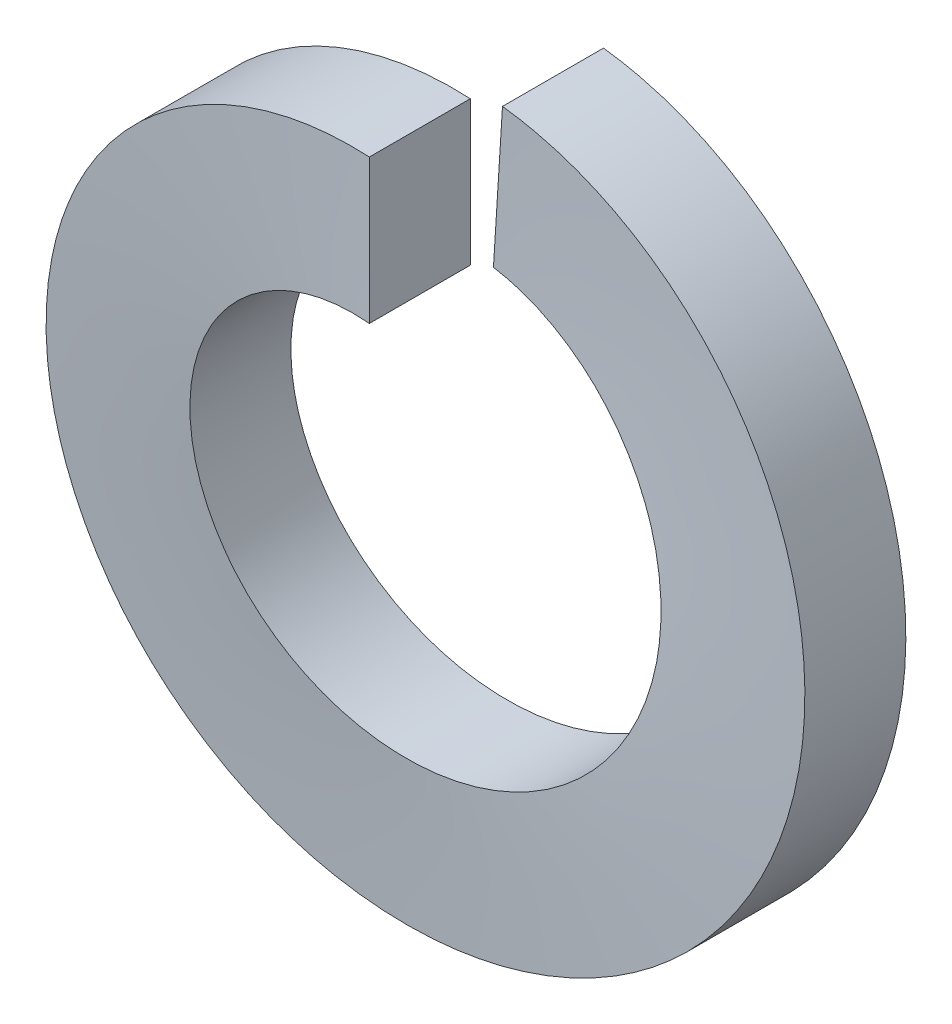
ISO-10303-21;
HEADER;
FILE_DESCRIPTION(('STEP AP214'),'2;1');
FILE_NAME('part.step','',(''),(''),'','','');
FILE_SCHEMA(('AUTOMOTIVE_DESIGN { 1 0 10303 214 1 1 1 1 }'));
ENDSEC;
DATA;
#1=APPLICATION_CONTEXT('core data for automotive mechanical design processes');
#2=APPLICATION_PROTOCOL_DEFINITION('international standard','automotive_design',2000,#1);
#3=PRODUCT_CONTEXT('',#1,'mechanical');
#4=PRODUCT('Part','Part','',(#3));
#5=PRODUCT_RELATED_PRODUCT_CATEGORY('part','',(#4));
#6=PRODUCT_DEFINITION_FORMATION('','',#4);
#7=PRODUCT_DEFINITION_CONTEXT('part definition',#1,'design');
#8=PRODUCT_DEFINITION('design','',#6,#7);
#9=PRODUCT_DEFINITION_SHAPE('','',#8);
#10=(LENGTH_UNIT() NAMED_UNIT(*) SI_UNIT(.MILLI.,.METRE.));
#11=(NAMED_UNIT(*) PLANE_ANGLE_UNIT() SI_UNIT($,.RADIAN.));
#12=(NAMED_UNIT(*) SI_UNIT($,.STERADIAN.) SOLID_ANGLE_UNIT());
#13=UNCERTAINTY_MEASURE_WITH_UNIT(LENGTH_MEASURE(1.E-05),#10,'distance_accuracy_value','');
#14=(GEOMETRIC_REPRESENTATION_CONTEXT(3) GLOBAL_UNCERTAINTY_ASSIGNED_CONTEXT((#13)) GLOBAL_UNIT_ASSIGNED_CONTEXT((#10,
#11,#12)) REPRESENTATION_CONTEXT('',''));
#15=CARTESIAN_POINT('',(0.,0.,0.));
#16=DIRECTION('',(0.,0.,1.));
#17=DIRECTION('',(1.,0.,0.));
#18=AXIS2_PLACEMENT_3D('',#15,#16,#17);
#19=CARTESIAN_POINT('',(0.,8.76935,3.175));
#20=DIRECTION('',(1.,0.,0.));
#21=DIRECTION('',(0.,0.,-1.));
#22=AXIS2_PLACEMENT_3D('',#19,#20,#21);
#23=PLANE('',#22);
#24=CARTESIAN_POINT('',(0.,11.0363,3.175));
#25=CARTESIAN_POINT('',(0.,6.5024,3.175));
#26=(BOUNDED_CURVE() B_SPLINE_CURVE(1,(#24,#25),.UNSPECIFIED.,.F.,
.F.) B_SPLINE_CURVE_WITH_KNOTS((2,2),(0.,1.),
.UNSPECIFIED.) CURVE() GEOMETRIC_REPRESENTATION_ITEM() RATIONAL_B_SPLINE_CURVE((1.,1.)) REPRESENTATION_ITEM(''));
#27=CARTESIAN_POINT('',(0.,11.0363,3.175));
#28=VERTEX_POINT('',#27);
#29=CARTESIAN_POINT('',(0.,6.5024,3.175));
#30=VERTEX_POINT('',#29);
#31=EDGE_CURVE('E57',#28,#30,#26,.T.);
#32=ORIENTED_EDGE('',*,*,#31,.T.);
#33=CARTESIAN_POINT('',(0.,6.5024,3.175));
#34=CARTESIAN_POINT('',(0.,6.5024,0.));
#35=(BOUNDED_CURVE() B_SPLINE_CURVE(1,(#33,#34),.UNSPECIFIED.,.F.,
.F.) B_SPLINE_CURVE_WITH_KNOTS((2,2),(0.,1.),
.UNSPECIFIED.) CURVE() GEOMETRIC_REPRESENTATION_ITEM() RATIONAL_B_SPLINE_CURVE((1.,1.)) REPRESENTATION_ITEM(''));
#36=CARTESIAN_POINT('',(0.,6.5024,0.));
#37=VERTEX_POINT('',#36);
#38=EDGE_CURVE('E89',#30,#37,#35,.T.);
#39=ORIENTED_EDGE('',*,*,#38,.T.);
#40=CARTESIAN_POINT('',(0.,6.5024,0.));
#41=CARTESIAN_POINT('',(0.,11.0363,0.));
#42=(BOUNDED_CURVE() B_SPLINE_CURVE(1,(#40,#41),.UNSPECIFIED.,.F.,
.F.) B_SPLINE_CURVE_WITH_KNOTS((2,2),(0.,1.),
.UNSPECIFIED.) CURVE() GEOMETRIC_REPRESENTATION_ITEM() RATIONAL_B_SPLINE_CURVE((1.,1.)) REPRESENTATION_ITEM(''));
#43=CARTESIAN_POINT('',(0.,11.0363,0.));
#44=VERTEX_POINT('',#43);
#45=EDGE_CURVE('E92',#37,#44,#42,.T.);
#46=ORIENTED_EDGE('',*,*,#45,.T.);
#47=CARTESIAN_POINT('',(0.,11.0363,0.));
#48=CARTESIAN_POINT('',(0.,11.0363,3.175));
#49=(BOUNDED_CURVE() B_SPLINE_CURVE(1,(#47,#48),.UNSPECIFIED.,.F.,
.F.) B_SPLINE_CURVE_WITH_KNOTS((2,2),(0.,1.),
.UNSPECIFIED.) CURVE() GEOMETRIC_REPRESENTATION_ITEM() RATIONAL_B_SPLINE_CURVE((1.,1.)) REPRESENTATION_ITEM(''));
#50=EDGE_CURVE('E72',#44,#28,#49,.T.);
#51=ORIENTED_EDGE('',*,*,#50,.T.);
#52=EDGE_LOOP('',(#32,#39,#46,#51));
#53=FACE_BOUND('',#52,.T.);
#54=ADVANCED_FACE('F46',(#53),#23,.T.);
#55=CARTESIAN_POINT('',(0.479479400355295,7.62080615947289,-0.318040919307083));
#56=DIRECTION('',(0.998026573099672,-0.062792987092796,1.26050761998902E-05));
#57=DIRECTION('',(0.0627929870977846,0.99802657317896,0.));
#58=AXIS2_PLACEMENT_3D('',#55,#56,#57);
#59=PLANE('',#58);
#60=CARTESIAN_POINT('',(0.693002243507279,11.014520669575,-0.318040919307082));
#61=CARTESIAN_POINT('',(0.408305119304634,6.48956798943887,-0.318040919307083));
#62=(BOUNDED_CURVE() B_SPLINE_CURVE(1,(#60,#61),.UNSPECIFIED.,.F.,
.F.) B_SPLINE_CURVE_WITH_KNOTS((2,2),(0.,1.),
.UNSPECIFIED.) CURVE() GEOMETRIC_REPRESENTATION_ITEM() RATIONAL_B_SPLINE_CURVE((0.992755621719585,0.992755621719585)) REPRESENTATION_ITEM(''));
#63=CARTESIAN_POINT('',(0.408320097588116,6.48956704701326,-0.318039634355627));
#64=VERTEX_POINT('',#63);
#65=CARTESIAN_POINT('',(0.693002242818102,11.0145206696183,-0.318040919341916));
#66=VERTEX_POINT('',#65);
#67=EDGE_CURVE('E12',#64,#66,#62,.F.);
#68=ORIENTED_EDGE('',*,*,#67,.T.);
#69=CARTESIAN_POINT('',(0.693002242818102,11.0145206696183,-3.49304091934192));
#70=CARTESIAN_POINT('',(0.693002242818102,11.0145206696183,-0.318040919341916));
#71=(BOUNDED_CURVE() B_SPLINE_CURVE(1,(#69,#70),.UNSPECIFIED.,.F.,
.F.) B_SPLINE_CURVE_WITH_KNOTS((2,2),(0.,1.),
.UNSPECIFIED.) CURVE() GEOMETRIC_REPRESENTATION_ITEM() RATIONAL_B_SPLINE_CURVE((0.992755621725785,0.992755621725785)) REPRESENTATION_ITEM(''));
#72=CARTESIAN_POINT('',(0.693027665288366,11.01451907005,-3.49303963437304));
#73=VERTEX_POINT('',#72);
#74=EDGE_CURVE('E134',#66,#73,#71,.F.);
#75=ORIENTED_EDGE('',*,*,#74,.T.);
#76=CARTESIAN_POINT('',(0.408335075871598,6.48956610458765,-3.49303834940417));
#77=CARTESIAN_POINT('',(0.69305308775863,11.0145174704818,-3.49303834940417));
#78=(BOUNDED_CURVE() B_SPLINE_CURVE(1,(#76,#77),.UNSPECIFIED.,.F.,
.F.) B_SPLINE_CURVE_WITH_KNOTS((2,2),(0.,1.),
.UNSPECIFIED.) CURVE() GEOMETRIC_REPRESENTATION_ITEM() RATIONAL_B_SPLINE_CURVE((0.992755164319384,0.992755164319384)) REPRESENTATION_ITEM(''));
#79=CARTESIAN_POINT('',(0.408335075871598,6.48956610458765,-3.49303834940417));
#80=VERTEX_POINT('',#79);
#81=EDGE_CURVE('E112',#73,#80,#78,.F.);
#82=ORIENTED_EDGE('',*,*,#81,.T.);
#83=CARTESIAN_POINT('',(0.408335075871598,6.48956610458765,-0.318038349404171));
#84=CARTESIAN_POINT('',(0.408335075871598,6.48956610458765,-3.49303834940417));
#85=(BOUNDED_CURVE() B_SPLINE_CURVE(1,(#83,#84),.UNSPECIFIED.,.F.,
.F.) B_SPLINE_CURVE_WITH_KNOTS((2,2),(0.,1.),
.UNSPECIFIED.) CURVE() GEOMETRIC_REPRESENTATION_ITEM() RATIONAL_B_SPLINE_CURVE((0.992755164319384,0.992755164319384)) REPRESENTATION_ITEM(''));
#86=EDGE_CURVE('E97',#80,#64,#85,.F.);
#87=ORIENTED_EDGE('',*,*,#86,.T.);
#88=EDGE_LOOP('',(#68,#75,#82,#87));
#89=FACE_BOUND('',#88,.T.);
#90=ADVANCED_FACE('F48',(#89),#59,.F.);
#91=CARTESIAN_POINT('',(0.,11.0363,3.175));
#92=CARTESIAN_POINT('',(-2.9571676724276,11.0363,3.02800925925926));
#93=CARTESIAN_POINT('',(-5.51815,9.5577161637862,2.88101851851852));
#94=CARTESIAN_POINT('',(-8.0791323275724,8.0791323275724,2.73402777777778));
#95=CARTESIAN_POINT('',(-9.5577161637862,5.51815,2.58703703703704));
#96=CARTESIAN_POINT('',(-11.0363,2.9571676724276,2.4400462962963));
#97=CARTESIAN_POINT('',(-11.0363,0.,2.29305555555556));
#98=CARTESIAN_POINT('',(-11.0363,-2.9571676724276,2.14606481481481));
#99=CARTESIAN_POINT('',(-9.5577161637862,-5.51815,1.99907407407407));
#100=CARTESIAN_POINT('',(-8.0791323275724,-8.0791323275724,1.85208333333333));
#101=CARTESIAN_POINT('',(-5.51815,-9.5577161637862,1.70509259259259));
#102=CARTESIAN_POINT('',(-2.9571676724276,-11.0363,1.55810185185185));
#103=CARTESIAN_POINT('',(0.,-11.0363,1.41111111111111));
#104=CARTESIAN_POINT('',(2.95716767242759,-11.0363,1.26412037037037));
#105=CARTESIAN_POINT('',(5.51815,-9.5577161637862,1.11712962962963));
#106=CARTESIAN_POINT('',(8.0791323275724,-8.0791323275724,0.970138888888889));
#107=CARTESIAN_POINT('',(9.5577161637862,-5.51815,0.823148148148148));
#108=CARTESIAN_POINT('',(11.0363,-2.95716767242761,0.676157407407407));
#109=CARTESIAN_POINT('',(11.0363,0.,0.529166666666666));
#110=CARTESIAN_POINT('',(11.0363,2.95716767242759,0.382175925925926));
#111=CARTESIAN_POINT('',(9.5577161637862,5.51814999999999,0.235185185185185));
#112=CARTESIAN_POINT('',(8.0791323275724,8.0791323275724,0.0881944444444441));
#113=CARTESIAN_POINT('',(5.51815,9.5577161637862,-0.0587962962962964));
#114=CARTESIAN_POINT('',(3.2764203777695,10.8519793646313,-0.187463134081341));
#115=CARTESIAN_POINT('',(0.693002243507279,11.014520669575,-0.318040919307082));
#116=CARTESIAN_POINT('',(0.,6.5024,3.175));
#117=CARTESIAN_POINT('',(-1.74231282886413,6.5024,3.02800925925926));
#118=CARTESIAN_POINT('',(-3.2512,5.63124358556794,2.88101851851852));
#119=CARTESIAN_POINT('',(-4.76008717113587,4.76008717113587,2.73402777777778));
#120=CARTESIAN_POINT('',(-5.63124358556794,3.2512,2.58703703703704));
#121=CARTESIAN_POINT('',(-6.5024,1.74231282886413,2.4400462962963));
#122=CARTESIAN_POINT('',(-6.5024,0.,2.29305555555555));
#123=CARTESIAN_POINT('',(-6.5024,-1.74231282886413,2.14606481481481));
#124=CARTESIAN_POINT('',(-5.63124358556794,-3.2512,1.99907407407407));
#125=CARTESIAN_POINT('',(-4.76008717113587,-4.76008717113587,1.85208333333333));
#126=CARTESIAN_POINT('',(-3.2512,-5.63124358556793,1.70509259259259));
#127=CARTESIAN_POINT('',(-1.74231282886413,-6.5024,1.55810185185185));
#128=CARTESIAN_POINT('',(0.,-6.5024,1.41111111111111));
#129=CARTESIAN_POINT('',(1.74231282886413,-6.5024,1.26412037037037));
#130=CARTESIAN_POINT('',(3.2512,-5.63124358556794,1.11712962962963));
#131=CARTESIAN_POINT('',(4.76008717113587,-4.76008717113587,0.970138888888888));
#132=CARTESIAN_POINT('',(5.63124358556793,-3.2512,0.823148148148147));
#133=CARTESIAN_POINT('',(6.5024,-1.74231282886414,0.676157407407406));
#134=CARTESIAN_POINT('',(6.5024,0.,0.529166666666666));
#135=CARTESIAN_POINT('',(6.5024,1.74231282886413,0.382175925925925));
#136=CARTESIAN_POINT('',(5.63124358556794,3.2512,0.235185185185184));
#137=CARTESIAN_POINT('',(4.76008717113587,4.76008717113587,0.0881944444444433));
#138=CARTESIAN_POINT('',(3.2512,5.63124358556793,-0.0587962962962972));
#139=CARTESIAN_POINT('',(1.93041108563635,6.39380142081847,-0.187463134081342));
#140=CARTESIAN_POINT('',(0.408305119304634,6.48956798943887,-0.318040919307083));
#141=(BOUNDED_SURFACE() B_SPLINE_SURFACE(1,2,((#91,#92,#93,#94,#95,#96,#97,#98,#99,#100,#101,
#102,#103,#104,#105,#106,#107,#108,#109,#110,#111,#112,#113,#114,#115),(#116,#117,#118,#119,
#120,#121,#122,#123,#124,#125,#126,#127,#128,#129,#130,#131,#132,#133,#134,#135,#136,#137,#138,
#139,#140)),.UNSPECIFIED.,.F.,.F.,.F.) B_SPLINE_SURFACE_WITH_KNOTS((2,2),(3,2,2,2,2,2,2,2,2,2,2,
2,3),(0.,1.),(0.,0.0833333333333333,0.166666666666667,0.25,0.333333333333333,0.416666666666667,
0.5,0.583333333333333,0.666666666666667,0.75,0.833333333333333,0.916666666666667,
0.989922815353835),
.UNSPECIFIED.) GEOMETRIC_REPRESENTATION_ITEM() RATIONAL_B_SPLINE_SURFACE(((1.,0.965925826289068,
1.,0.965925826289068,1.,0.965925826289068,1.,0.965925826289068,1.,0.965925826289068,1.,
0.965925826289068,1.,0.965925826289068,1.,0.965925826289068,1.,0.965925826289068,1.,
0.965925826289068,1.,0.965925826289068,1.,0.970046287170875,0.992755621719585),(1.,
0.965925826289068,1.,0.965925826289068,1.,0.965925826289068,1.,0.965925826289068,1.,
0.965925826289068,1.,0.965925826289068,1.,0.965925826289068,1.,0.965925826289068,1.,
0.965925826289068,1.,0.965925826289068,1.,0.965925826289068,1.,0.970046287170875,0.992755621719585))) REPRESENTATION_ITEM('') SURFACE());
#142=CARTESIAN_POINT('',(0.,11.0363,3.175));
#143=CARTESIAN_POINT('',(-2.9571676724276,11.0363,3.02800925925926));
#144=CARTESIAN_POINT('',(-5.51815,9.5577161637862,2.88101851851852));
#145=CARTESIAN_POINT('',(-8.0791323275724,8.0791323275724,2.73402777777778));
#146=CARTESIAN_POINT('',(-9.5577161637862,5.51815,2.58703703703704));
#147=CARTESIAN_POINT('',(-11.0363,2.9571676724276,2.4400462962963));
#148=CARTESIAN_POINT('',(-11.0363,0.,2.29305555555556));
#149=CARTESIAN_POINT('',(-11.0363,-2.9571676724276,2.14606481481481));
#150=CARTESIAN_POINT('',(-9.5577161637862,-5.51815,1.99907407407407));
#151=CARTESIAN_POINT('',(-8.0791323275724,-8.0791323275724,1.85208333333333));
#152=CARTESIAN_POINT('',(-5.51815,-9.5577161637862,1.70509259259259));
#153=CARTESIAN_POINT('',(-2.9571676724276,-11.0363,1.55810185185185));
#154=CARTESIAN_POINT('',(0.,-11.0363,1.41111111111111));
#155=CARTESIAN_POINT('',(2.95716767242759,-11.0363,1.26412037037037));
#156=CARTESIAN_POINT('',(5.51815,-9.5577161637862,1.11712962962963));
#157=CARTESIAN_POINT('',(8.0791323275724,-8.0791323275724,0.970138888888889));
#158=CARTESIAN_POINT('',(9.5577161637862,-5.51815,0.823148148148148));
#159=CARTESIAN_POINT('',(11.0363,-2.95716767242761,0.676157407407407));
#160=CARTESIAN_POINT('',(11.0363,0.,0.529166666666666));
#161=CARTESIAN_POINT('',(11.0363,2.95716767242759,0.382175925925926));
#162=CARTESIAN_POINT('',(9.5577161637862,5.51814999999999,0.235185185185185));
#163=CARTESIAN_POINT('',(8.0791323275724,8.0791323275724,0.0881944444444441));
#164=CARTESIAN_POINT('',(5.51815,9.5577161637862,-0.0587962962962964));
#165=CARTESIAN_POINT('',(3.27642037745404,10.8519793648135,-0.187463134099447));
#166=CARTESIAN_POINT('',(0.693002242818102,11.0145206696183,-0.318040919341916));
#167=(BOUNDED_CURVE() B_SPLINE_CURVE(2,(#142,#143,#144,#145,#146,#147,#148,#149,#150,#151,#152,
#153,#154,#155,#156,#157,#158,#159,#160,#161,#162,#163,#164,#165,#166),.UNSPECIFIED.,.F.,
.F.) B_SPLINE_CURVE_WITH_KNOTS((3,2,2,2,2,2,2,2,2,2,2,2,3),(0.,0.0833333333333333,
0.166666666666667,0.25,0.333333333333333,0.416666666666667,0.5,0.583333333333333,
0.666666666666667,0.75,0.833333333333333,0.916666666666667,0.989922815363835),
.UNSPECIFIED.) CURVE() GEOMETRIC_REPRESENTATION_ITEM() RATIONAL_B_SPLINE_CURVE((1.,
0.965925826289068,1.,0.965925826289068,1.,0.965925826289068,1.,0.965925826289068,1.,
0.965925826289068,1.,0.965925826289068,1.,0.965925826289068,1.,0.965925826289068,1.,
0.965925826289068,1.,0.965925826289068,1.,0.965925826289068,1.,0.970046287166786,0.992755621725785)) REPRESENTATION_ITEM(''));
#168=EDGE_CURVE('E64',#28,#66,#167,.T.);
#169=CARTESIAN_POINT('',(0.,6.5024,3.175));
#170=CARTESIAN_POINT('',(-0.12862264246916,6.50240470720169,3.16414882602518));
#171=CARTESIAN_POINT('',(-0.257237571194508,6.49858381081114,3.15321181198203));
#172=CARTESIAN_POINT('',(-0.514793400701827,6.48328014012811,3.13113708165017));
#173=CARTESIAN_POINT('',(-0.643731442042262,6.47175039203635,3.11999854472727));
#174=CARTESIAN_POINT('',(-0.901240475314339,6.44095208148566,3.09757751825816));
#175=CARTESIAN_POINT('',(-1.02980743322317,6.42165008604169,3.08629461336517));
#176=CARTESIAN_POINT('',(-1.28587219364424,6.37532029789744,3.06364426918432));
#177=CARTESIAN_POINT('',(-1.41336647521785,6.34827311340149,3.05227668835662));
#178=CARTESIAN_POINT('',(-1.66658659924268,6.28654829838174,3.02951856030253));
#179=CARTESIAN_POINT('',(-1.79231115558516,6.25186539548,3.01812800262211));
#180=CARTESIAN_POINT('',(-2.04130803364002,6.17504841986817,2.99538410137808));
#181=CARTESIAN_POINT('',(-2.16458299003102,6.13292289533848,2.98403073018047));
#182=CARTESIAN_POINT('',(-2.40802528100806,6.04147962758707,2.96142816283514));
#183=CARTESIAN_POINT('',(-2.52820074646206,5.99218358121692,2.95017875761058));
#184=CARTESIAN_POINT('',(-2.76482618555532,5.88673426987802,2.92782221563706));
#185=CARTESIAN_POINT('',(-2.88129119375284,5.83061483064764,2.91671465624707));
#186=CARTESIAN_POINT('',(-3.10998855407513,5.71188882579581,2.8947730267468));
#187=CARTESIAN_POINT('',(-3.22224231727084,5.64932373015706,2.8839377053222));
#188=CARTESIAN_POINT('',(-3.44316664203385,5.51746392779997,2.86212153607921));
#189=CARTESIAN_POINT('',(-3.55182556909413,5.44814978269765,2.85114035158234));
#190=CARTESIAN_POINT('',(-3.76543325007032,5.30278259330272,2.82897782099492));
#191=CARTESIAN_POINT('',(-3.87035727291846,5.22669332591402,2.81779568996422));
#192=CARTESIAN_POINT('',(-4.07586777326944,5.06807868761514,2.79530538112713));
#193=CARTESIAN_POINT('',(-4.17643572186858,4.98552935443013,2.78399688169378));
#194=CARTESIAN_POINT('',(-4.37264130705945,4.81437396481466,2.76130931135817));
#195=CARTESIAN_POINT('',(-4.46826826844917,4.7257556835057,2.74993014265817));
#196=CARTESIAN_POINT('',(-4.65404685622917,4.54291141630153,2.72716406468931));
#197=CARTESIAN_POINT('',(-4.74419714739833,4.44868407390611,2.7157771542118));
#198=CARTESIAN_POINT('',(-4.9185347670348,4.25513319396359,2.69305613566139));
#199=CARTESIAN_POINT('',(-5.00273134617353,4.15581799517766,2.68172197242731));
#200=CARTESIAN_POINT('',(-5.16474026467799,3.95265561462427,2.65917051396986));
#201=CARTESIAN_POINT('',(-5.24257339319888,3.84882503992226,2.64795295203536));
#202=CARTESIAN_POINT('',(-5.39150670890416,3.63723960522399,2.62568217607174));
#203=CARTESIAN_POINT('',(-5.46263984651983,3.52950799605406,2.61462841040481));
#204=CARTESIAN_POINT('',(-5.59803176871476,3.31054806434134,2.59276321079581));
#205=CARTESIAN_POINT('',(-5.66232369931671,3.19934033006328,2.5819508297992));
#206=CARTESIAN_POINT('',(-5.78450856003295,2.9727626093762,2.5600904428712));
#207=CARTESIAN_POINT('',(-5.84236792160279,2.85737460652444,2.54904152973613));
#208=CARTESIAN_POINT('',(-5.95140281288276,2.62275270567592,2.52677820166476));
#209=CARTESIAN_POINT('',(-6.0025415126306,2.503501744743,2.51556322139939));
#210=CARTESIAN_POINT('',(-6.09775822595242,2.26174425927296,2.49301607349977));
#211=CARTESIAN_POINT('',(-6.1418112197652,2.13922790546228,2.48168363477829));
#212=CARTESIAN_POINT('',(-6.22255120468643,1.89157411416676,2.45896477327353));
#213=CARTESIAN_POINT('',(-6.25922608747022,1.76643273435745,2.44757829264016));
#214=CARTESIAN_POINT('',(-6.32498174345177,1.51419773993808,2.42481192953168));
#215=CARTESIAN_POINT('',(-6.35406408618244,1.3871045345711,2.41343204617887));
#216=CARTESIAN_POINT('',(-6.40448851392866,1.1316568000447,2.39074168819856));
#217=CARTESIAN_POINT('',(-6.4258462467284,1.00330536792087,2.37943111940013));
#218=CARTESIAN_POINT('',(-6.46075944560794,0.746042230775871,2.35693608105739));
#219=CARTESIAN_POINT('',(-6.47434465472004,0.617134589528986,2.3457512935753));
#220=CARTESIAN_POINT('',(-6.49373519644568,0.359455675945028,2.32358020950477));
#221=CARTESIAN_POINT('',(-6.49958400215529,0.230687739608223,2.31259314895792));
#222=CARTESIAN_POINT('',(-6.50361405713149,-0.026571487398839,2.29077454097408));
#223=CARTESIAN_POINT('',(-6.50181945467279,-0.155062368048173,2.27994261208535));
#224=CARTESIAN_POINT('',(-6.49059088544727,-0.412473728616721,2.2580081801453));
#225=CARTESIAN_POINT('',(-6.48111064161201,-0.541392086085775,2.24690443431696));
#226=CARTESIAN_POINT('',(-6.45442351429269,-0.799047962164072,2.22455423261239));
#227=CARTESIAN_POINT('',(-6.43717955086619,-0.927781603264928,2.21330734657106));
#228=CARTESIAN_POINT('',(-6.39495425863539,-1.18436542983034,2.19070862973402));
#229=CARTESIAN_POINT('',(-6.36994979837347,-1.3122117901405,2.17935658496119));
#230=CARTESIAN_POINT('',(-6.3122769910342,-1.56632025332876,2.15661434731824));
#231=CARTESIAN_POINT('',(-6.27959964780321,-1.69258031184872,2.14522412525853));
#232=CARTESIAN_POINT('',(-6.20673837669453,-1.94282692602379,2.12246462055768));
#233=CARTESIAN_POINT('',(-6.16655938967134,-2.06681491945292,2.11109532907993));
#234=CARTESIAN_POINT('',(-6.07893312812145,-2.31185338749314,2.08844351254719));
#235=CARTESIAN_POINT('',(-6.03150415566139,-2.43291039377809,2.07716084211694));
#236=CARTESIAN_POINT('',(-5.92969340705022,-2.67145795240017,2.05472745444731));
#237=CARTESIAN_POINT('',(-5.87534236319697,-2.78896158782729,2.04357637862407));
#238=CARTESIAN_POINT('',(-5.76006974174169,-3.01982561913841,2.02151873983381));
#239=CARTESIAN_POINT('',(-5.69919010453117,-3.13320685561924,2.01061110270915));
#240=CARTESIAN_POINT('',(-5.57082956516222,-3.35612898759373,1.98880949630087));
#241=CARTESIAN_POINT('',(-5.50335045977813,-3.46567091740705,1.97791552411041));
#242=CARTESIAN_POINT('',(-5.36158768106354,-3.68121252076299,1.95587711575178));
#243=CARTESIAN_POINT('',(-5.28726452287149,-3.7871861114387,1.9447315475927));
#244=CARTESIAN_POINT('',(-5.13209384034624,-3.9949597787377,1.922308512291));
#245=CARTESIAN_POINT('',(-5.05121914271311,-4.09673952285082,1.91103068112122));
#246=CARTESIAN_POINT('',(-4.88330570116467,-4.29552115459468,1.88838573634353));
#247=CARTESIAN_POINT('',(-4.79625169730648,-4.39251013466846,1.87701846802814));
#248=CARTESIAN_POINT('',(-4.61641067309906,-4.58115189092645,1.85426072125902));
#249=CARTESIAN_POINT('',(-4.52361952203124,-4.67280072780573,1.84287023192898));
#250=CARTESIAN_POINT('',(-4.33280014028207,-4.85025833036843,1.8201249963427));
#251=CARTESIAN_POINT('',(-4.23477781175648,-4.93607343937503,1.80877022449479));
#252=CARTESIAN_POINT('',(-4.0340470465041,-5.10142418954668,1.78616376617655));
#253=CARTESIAN_POINT('',(-3.93135317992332,-5.18097749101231,1.77491187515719));
#254=CARTESIAN_POINT('',(-3.72187762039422,-5.33343555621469,1.7525491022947));
#255=CARTESIAN_POINT('',(-3.61511758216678,-5.40637001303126,1.74143780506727));
#256=CARTESIAN_POINT('',(-3.39809108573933,-5.54532975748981,1.71948878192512));
#257=CARTESIAN_POINT('',(-3.28785004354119,-5.61139454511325,1.70864979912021));
#258=CARTESIAN_POINT('',(-3.06334564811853,-5.73704748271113,1.68683588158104));
#259=CARTESIAN_POINT('',(-2.94907200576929,-5.79661719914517,1.67586065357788));
#260=CARTESIAN_POINT('',(-2.71653314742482,-5.90918229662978,1.65370676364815));
#261=CARTESIAN_POINT('',(-2.59824876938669,-5.96213793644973,1.64252729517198));
#262=CARTESIAN_POINT('',(-2.35826313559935,-6.06108180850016,1.62004174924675));
#263=CARTESIAN_POINT('',(-2.2365502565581,-6.10704177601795,1.60873534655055));
#264=CARTESIAN_POINT('',(-1.99033177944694,-6.19166918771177,1.58605061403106));
#265=CARTESIAN_POINT('',(-1.86582082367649,-6.23032101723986,1.57467218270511));
#266=CARTESIAN_POINT('',(-1.61466693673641,-6.30008312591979,1.55190643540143));
#267=CARTESIAN_POINT('',(-1.48802342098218,-6.3311912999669,1.54051911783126));
#268=CARTESIAN_POINT('',(-1.23329084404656,-6.38569793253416,1.51779599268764));
#269=CARTESIAN_POINT('',(-1.10520433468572,-6.40910829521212,1.50646013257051));
#270=CARTESIAN_POINT('',(-0.848284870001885,-6.44813492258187,1.48390439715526));
#271=CARTESIAN_POINT('',(-0.71945589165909,-6.46377721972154,1.47268425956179));
#272=CARTESIAN_POINT('',(-0.461752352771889,-6.48726793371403,1.45040612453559));
#273=CARTESIAN_POINT('',(-0.332881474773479,-6.49515624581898,1.43934758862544));
#274=CARTESIAN_POINT('',(-0.0755540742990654,-6.50322841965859,1.41747738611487));
#275=CARTESIAN_POINT('',(0.0529011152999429,-6.50345215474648,1.40666473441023));
#276=CARTESIAN_POINT('',(0.310209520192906,-6.49627761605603,1.38480897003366));
#277=CARTESIAN_POINT('',(0.439061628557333,-6.48884222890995,1.37376499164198));
#278=CARTESIAN_POINT('',(0.696768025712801,-6.46626157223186,1.3515092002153));
#279=CARTESIAN_POINT('',(0.825618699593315,-6.45107560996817,1.34029680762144));
#280=CARTESIAN_POINT('',(1.08262288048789,-6.41296097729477,1.3177540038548));
#281=CARTESIAN_POINT('',(1.21077238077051,-6.39000544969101,1.30642331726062));
#282=CARTESIAN_POINT('',(1.46567199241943,-6.33640286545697,1.28370666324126));
#283=CARTESIAN_POINT('',(1.59241942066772,-6.30574307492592,1.27232063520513));
#284=CARTESIAN_POINT('',(1.84382130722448,-6.23686720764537,1.24955403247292));
#285=CARTESIAN_POINT('',(1.96847611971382,-6.19865242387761,1.23817345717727));
#286=CARTESIAN_POINT('',(2.21502079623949,-6.11488389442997,1.21548036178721));
#287=CARTESIAN_POINT('',(2.33691569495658,-6.06934499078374,1.20416775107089));
#288=CARTESIAN_POINT('',(2.57730169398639,-5.97122354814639,1.18166801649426));
#289=CARTESIAN_POINT('',(2.69580401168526,-5.91866856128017,1.17048057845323));
#290=CARTESIAN_POINT('',(2.92881157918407,-5.80688144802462,1.14830102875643));
#291=CARTESIAN_POINT('',(3.04333551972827,-5.74768842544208,1.13730817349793));
#292=CARTESIAN_POINT('',(3.26829577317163,-5.62280556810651,1.11548693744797));
#293=CARTESIAN_POINT('',(3.37874448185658,-5.55713813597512,1.10465812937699));
#294=CARTESIAN_POINT('',(3.5961972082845,-5.41897283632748,1.08273070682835));
#295=CARTESIAN_POINT('',(3.70317650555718,-5.34643625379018,1.07163086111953));
#296=CARTESIAN_POINT('',(3.91312747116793,-5.19475614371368,1.04928707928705));
#297=CARTESIAN_POINT('',(4.01607712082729,-5.1155822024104,1.03804270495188));
#298=CARTESIAN_POINT('',(4.2173542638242,-4.95096789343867,1.01544790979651));
#299=CARTESIAN_POINT('',(4.31566672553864,-4.86550917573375,1.00409727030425));
#300=CARTESIAN_POINT('',(4.50709839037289,-4.68873798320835,0.98135660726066));
#301=CARTESIAN_POINT('',(4.60021114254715,-4.59741852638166,0.969966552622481));
#302=CARTESIAN_POINT('',(4.78072401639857,-4.40940547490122,0.94720623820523));
#303=CARTESIAN_POINT('',(4.86812764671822,-4.31271524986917,0.935835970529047));
#304=CARTESIAN_POINT('',(5.03676506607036,-4.11449801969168,0.913180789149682));
#305=CARTESIAN_POINT('',(5.11801343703,-4.01298343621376,0.901895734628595));
#306=CARTESIAN_POINT('',(5.27395201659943,-3.8057042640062,0.879457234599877));
#307=CARTESIAN_POINT('',(5.34866868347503,-3.69995961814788,0.868303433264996));
#308=CARTESIAN_POINT('',(5.49123381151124,-3.48483944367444,0.846236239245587));
#309=CARTESIAN_POINT('',(5.55912104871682,-3.37548971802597,0.835321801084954));
#310=CARTESIAN_POINT('',(5.6882549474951,-3.15301365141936,0.813519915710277));
#311=CARTESIAN_POINT('',(5.74950515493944,-3.039889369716,0.80263245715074));
#312=CARTESIAN_POINT('',(5.86554345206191,-2.8095097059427,0.78060344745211));
#313=CARTESIAN_POINT('',(5.92028906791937,-2.69223303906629,0.769460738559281));
#314=CARTESIAN_POINT('',(6.02291117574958,-2.45410462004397,0.747042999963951));
#315=CARTESIAN_POINT('',(6.07075624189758,-2.33323935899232,0.735767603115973));
#316=CARTESIAN_POINT('',(6.15923260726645,-2.08854714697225,0.713126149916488));
#317=CARTESIAN_POINT('',(6.19984484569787,-1.96471331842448,0.701759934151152));
#318=CARTESIAN_POINT('',(6.27358602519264,-1.71473573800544,0.679003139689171));
#319=CARTESIAN_POINT('',(6.30670922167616,-1.58859029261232,0.667612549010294));
#320=CARTESIAN_POINT('',(6.36528231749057,-1.33467047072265,0.644865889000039));
#321=CARTESIAN_POINT('',(6.39074038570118,-1.20689798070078,0.633509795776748));
#322=CARTESIAN_POINT('',(6.4338765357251,-0.950420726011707,0.610899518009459));
#323=CARTESIAN_POINT('',(6.45157692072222,-0.821719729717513,0.599645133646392));
#324=CARTESIAN_POINT('',(6.47917556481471,-0.564088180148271,0.577276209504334));
#325=CARTESIAN_POINT('',(6.48911009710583,-0.435161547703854,0.566161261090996));
#326=CARTESIAN_POINT('',(6.50124009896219,-0.17772137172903,0.544204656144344));
#327=CARTESIAN_POINT('',(6.503482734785,-0.0492101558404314,0.533361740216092));
#328=CARTESIAN_POINT('',(6.50034732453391,0.208040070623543,0.511549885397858));
#329=CARTESIAN_POINT('',(6.49494975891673,0.336778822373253,0.500580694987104));
#330=CARTESIAN_POINT('',(6.47646714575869,0.594439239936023,0.478435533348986));
#331=CARTESIAN_POINT('',(6.46333783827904,0.72335766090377,0.467258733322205));
#332=CARTESIAN_POINT('',(6.42933707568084,0.98068367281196,0.444777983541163));
#333=CARTESIAN_POINT('',(6.40843505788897,1.10908719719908,0.433473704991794));
#334=CARTESIAN_POINT('',(6.35891774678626,1.36468026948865,0.410791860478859));
#335=CARTESIAN_POINT('',(6.33028597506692,1.49186661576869,0.399414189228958));
#336=CARTESIAN_POINT('',(6.26542222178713,1.74432838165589,0.376648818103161));
#337=CARTESIAN_POINT('',(6.22918785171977,1.86960318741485,0.365261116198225));
#338=CARTESIAN_POINT('',(6.14931489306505,2.11756283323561,0.342535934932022));
#339=CARTESIAN_POINT('',(6.10568762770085,2.24025131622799,0.331198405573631));
#340=CARTESIAN_POINT('',(6.01130383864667,2.48239000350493,0.308638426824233));
#341=CARTESIAN_POINT('',(5.96057160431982,2.60184965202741,0.297415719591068));
#342=CARTESIAN_POINT('',(5.85232717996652,2.83692280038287,0.2751303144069));
#343=CARTESIAN_POINT('',(5.79485116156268,2.95255290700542,0.264067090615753));
#344=CARTESIAN_POINT('',(5.67343403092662,3.17959665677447,0.242191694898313));
#345=CARTESIAN_POINT('',(5.60952887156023,3.29102943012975,0.231378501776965));
#346=CARTESIAN_POINT('',(5.47492323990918,3.51042223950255,0.20952716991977));
#347=CARTESIAN_POINT('',(5.40419201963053,3.61836333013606,0.198488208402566));
#348=CARTESIAN_POINT('',(5.2560460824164,3.83040483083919,0.176240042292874));
#349=CARTESIAN_POINT('',(5.17859769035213,3.93448165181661,0.165030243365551));
#350=CARTESIAN_POINT('',(5.01733708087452,4.1381720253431,0.142491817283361));
#351=CARTESIAN_POINT('',(4.93350337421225,4.2377685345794,0.131162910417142));
#352=CARTESIAN_POINT('',(4.75986618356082,4.43191483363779,0.108448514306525));
#353=CARTESIAN_POINT('',(4.67005279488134,4.52645575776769,0.0970629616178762));
#354=CARTESIAN_POINT('',(4.48491887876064,4.70995678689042,0.074296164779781));
#355=CARTESIAN_POINT('',(4.38959909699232,4.79891764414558,0.0629149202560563));
#356=CARTESIAN_POINT('',(4.19397551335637,4.97078398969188,0.0402191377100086));
#357=CARTESIAN_POINT('',(4.09368187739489,5.05370103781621,0.0289045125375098));
#358=CARTESIAN_POINT('',(3.88868483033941,5.21307279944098,0.00640011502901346));
#359=CARTESIAN_POINT('',(3.78399953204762,5.28955076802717,-0.00478996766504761));
#360=CARTESIAN_POINT('',(3.57083270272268,5.43571222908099,-0.0269778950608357));
#361=CARTESIAN_POINT('',(3.46237558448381,5.50543121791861,-0.0379764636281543));
#362=CARTESIAN_POINT('',(3.24188969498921,5.63807138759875,-0.0598005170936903));
#363=CARTESIAN_POINT('',(3.12987488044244,5.70101569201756,-0.0706264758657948));
#364=CARTESIAN_POINT('',(2.90165163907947,5.82050814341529,-0.0925470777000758));
#365=CARTESIAN_POINT('',(2.78542219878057,5.87701593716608,-0.103642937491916));
#366=CARTESIAN_POINT('',(2.54923411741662,5.98326506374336,-0.125980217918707));
#367=CARTESIAN_POINT('',(2.42925999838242,6.03297189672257,-0.137222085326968));
#368=CARTESIAN_POINT('',(2.18618374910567,6.1252558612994,-0.159812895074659));
#369=CARTESIAN_POINT('',(2.06307311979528,6.16781055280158,-0.171162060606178));
#370=CARTESIAN_POINT('',(1.81436606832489,6.24550038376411,-0.193901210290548));
#371=CARTESIAN_POINT('',(1.68876673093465,6.28062618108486,-0.205291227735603));
#372=CARTESIAN_POINT('',(1.43575677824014,6.34324707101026,-0.228051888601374));
#373=CARTESIAN_POINT('',(1.30834726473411,6.37074661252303,-0.239422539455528));
#374=CARTESIAN_POINT('',(1.05241077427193,6.41798454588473,-0.262082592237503));
#375=CARTESIAN_POINT('',(0.923887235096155,6.43774150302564,-0.273372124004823));
#376=CARTESIAN_POINT('',(0.666424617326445,6.46945538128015,-0.295809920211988));
#377=CARTESIAN_POINT('',(0.53748958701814,6.48144489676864,-0.306958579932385));
#378=CARTESIAN_POINT('',(0.408305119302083,6.48956798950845,-0.31804091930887));
#379=B_SPLINE_CURVE_WITH_KNOTS('',3,(#169,#170,#171,#172,#173,#174,#175,#176,#177,#178,#179,
#180,#181,#182,#183,#184,#185,#186,#187,#188,#189,#190,#191,#192,#193,#194,#195,#196,#197,#198,
#199,#200,#201,#202,#203,#204,#205,#206,#207,#208,#209,#210,#211,#212,#213,#214,#215,#216,#217,
#218,#219,#220,#221,#222,#223,#224,#225,#226,#227,#228,#229,#230,#231,#232,#233,#234,#235,#236,
#237,#238,#239,#240,#241,#242,#243,#244,#245,#246,#247,#248,#249,#250,#251,#252,#253,#254,#255,
#256,#257,#258,#259,#260,#261,#262,#263,#264,#265,#266,#267,#268,#269,#270,#271,#272,#273,#274,
#275,#276,#277,#278,#279,#280,#281,#282,#283,#284,#285,#286,#287,#288,#289,#290,#291,#292,#293,
#294,#295,#296,#297,#298,#299,#300,#301,#302,#303,#304,#305,#306,#307,#308,#309,#310,#311,#312,
#313,#314,#315,#316,#317,#318,#319,#320,#321,#322,#323,#324,#325,#326,#327,#328,#329,#330,#331,
#332,#333,#334,#335,#336,#337,#338,#339,#340,#341,#342,#343,#344,#345,#346,#347,#348,#349,#350,
#351,#352,#353,#354,#355,#356,#357,#358,#359,#360,#361,#362,#363,#364,#365,#366,#367,#368,#369,
#370,#371,#372,#373,#374,#375,#376,#377,#378),.UNSPECIFIED.,.F.,.F.,(4,2,2,2,2,2,2,2,2,2,2,2,2,
2,2,2,2,2,2,2,2,2,2,2,2,2,2,2,2,2,2,2,2,2,2,2,2,2,2,2,2,2,2,2,2,2,2,2,2,2,2,2,2,2,2,2,2,2,2,2,2,
2,2,2,2,2,2,2,2,2,2,2,2,2,2,2,2,2,2,2,2,2,2,2,2,2,2,2,2,2,2,2,2,2,2,2,2,2,2,2,2,2,2,2,4),(0.,
0.387181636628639,0.776744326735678,1.16800096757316,1.56024590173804,1.95276253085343,
2.34483123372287,2.73573736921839,3.12477913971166,3.51145804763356,3.8992855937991,
4.28932789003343,4.68089260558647,5.07327068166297,5.46574403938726,5.85759353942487,
6.24810697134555,6.63658684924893,7.02308945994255,7.41152273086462,7.80200300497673,
8.19383315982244,8.58630119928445,8.97868804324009,9.37027551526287,9.76035430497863,
10.1482316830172,10.5348845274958,10.923882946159,11.3147592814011,11.7068120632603,
12.0993268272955,12.4915839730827,12.8828667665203,13.2724692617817,13.6597039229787,
14.0468334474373,14.4363560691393,14.8275862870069,15.2198187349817,15.6123369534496,
16.0044213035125,16.3953569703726,16.7844418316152,17.171148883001,17.5589263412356,
17.9489318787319,18.3404735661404,18.7328425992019,19.1253209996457,19.5171895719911,
19.9077358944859,20.2962621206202,20.6827668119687,21.0711532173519,21.4616000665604,
21.8534106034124,22.2458730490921,22.6382683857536,23.0298783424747,23.4199933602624,
23.8079203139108,24.1945491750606,24.5835039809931,24.9743502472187,25.3663868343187,
25.758899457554,26.1511685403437,26.5424772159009,26.9321192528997,27.319406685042,
27.7064861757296,28.095968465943,28.4871719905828,28.8793916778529,29.2719112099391,
29.664010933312,30.0549758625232,30.4441035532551,30.8308408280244,31.2185679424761,
31.6085364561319,32.0000548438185,32.3924145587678,32.7848977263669,33.1767850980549,
33.5673640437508,33.9559363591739,34.3424452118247,34.7307844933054,35.1211976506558,
35.5129882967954,35.9054448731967,36.2978484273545,36.6894805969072,37.0796315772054,
37.4676078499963,37.8542148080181,38.2431257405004,38.6339416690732,39.025961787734,
39.4184719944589,39.8107527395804,40.2020870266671,40.5917683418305),.UNSPECIFIED.);
#380=EDGE_CURVE('E106',#30,#64,#379,.T.);
#381=ORIENTED_EDGE('',*,*,#31,.F.);
#382=ORIENTED_EDGE('',*,*,#168,.T.);
#383=ORIENTED_EDGE('',*,*,#67,.F.);
#384=ORIENTED_EDGE('',*,*,#380,.F.);
#385=EDGE_LOOP('',(#381,#382,#383,#384));
#386=FACE_BOUND('',#385,.T.);
#387=ADVANCED_FACE('F203',(#386),#141,.F.);
#388=CARTESIAN_POINT('',(0.,11.0363,0.));
#389=CARTESIAN_POINT('',(-2.9571676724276,11.0363,-0.146990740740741));
#390=CARTESIAN_POINT('',(-5.51815,9.5577161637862,-0.293981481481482));
#391=CARTESIAN_POINT('',(-8.0791323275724,8.0791323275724,-0.440972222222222));
#392=CARTESIAN_POINT('',(-9.5577161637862,5.51815,-0.587962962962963));
#393=CARTESIAN_POINT('',(-11.0363,2.9571676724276,-0.734953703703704));
#394=CARTESIAN_POINT('',(-11.0363,0.,-0.881944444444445));
#395=CARTESIAN_POINT('',(-11.0363,-2.9571676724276,-1.02893518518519));
#396=CARTESIAN_POINT('',(-9.5577161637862,-5.51815,-1.17592592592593));
#397=CARTESIAN_POINT('',(-8.0791323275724,-8.0791323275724,-1.32291666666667));
#398=CARTESIAN_POINT('',(-5.51815,-9.5577161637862,-1.46990740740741));
#399=CARTESIAN_POINT('',(-2.9571676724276,-11.0363,-1.61689814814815));
#400=CARTESIAN_POINT('',(0.,-11.0363,-1.76388888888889));
#401=CARTESIAN_POINT('',(2.95716767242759,-11.0363,-1.91087962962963));
#402=CARTESIAN_POINT('',(5.51815,-9.5577161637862,-2.05787037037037));
#403=CARTESIAN_POINT('',(8.0791323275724,-8.0791323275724,-2.20486111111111));
#404=CARTESIAN_POINT('',(9.5577161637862,-5.51815,-2.35185185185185));
#405=CARTESIAN_POINT('',(11.0363,-2.95716767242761,-2.49884259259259));
#406=CARTESIAN_POINT('',(11.0363,0.,-2.64583333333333));
#407=CARTESIAN_POINT('',(11.0363,2.95716767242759,-2.79282407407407));
#408=CARTESIAN_POINT('',(9.5577161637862,5.51814999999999,-2.93981481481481));
#409=CARTESIAN_POINT('',(8.0791323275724,8.0791323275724,-3.08680555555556));
#410=CARTESIAN_POINT('',(5.51815,9.5577161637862,-3.2337962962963));
#411=CARTESIAN_POINT('',(3.27642037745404,10.8519793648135,-3.36246313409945));
#412=CARTESIAN_POINT('',(0.693002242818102,11.0145206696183,-3.49304091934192));
#413=CARTESIAN_POINT('',(0.,11.0363,3.175));
#414=CARTESIAN_POINT('',(-2.9571676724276,11.0363,3.02800925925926));
#415=CARTESIAN_POINT('',(-5.51815,9.5577161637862,2.88101851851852));
#416=CARTESIAN_POINT('',(-8.0791323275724,8.0791323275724,2.73402777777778));
#417=CARTESIAN_POINT('',(-9.5577161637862,5.51815,2.58703703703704));
#418=CARTESIAN_POINT('',(-11.0363,2.9571676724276,2.4400462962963));
#419=CARTESIAN_POINT('',(-11.0363,0.,2.29305555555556));
#420=CARTESIAN_POINT('',(-11.0363,-2.9571676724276,2.14606481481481));
#421=CARTESIAN_POINT('',(-9.5577161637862,-5.51815,1.99907407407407));
#422=CARTESIAN_POINT('',(-8.0791323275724,-8.0791323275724,1.85208333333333));
#423=CARTESIAN_POINT('',(-5.51815,-9.5577161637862,1.70509259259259));
#424=CARTESIAN_POINT('',(-2.9571676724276,-11.0363,1.55810185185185));
#425=CARTESIAN_POINT('',(0.,-11.0363,1.41111111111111));
#426=CARTESIAN_POINT('',(2.95716767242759,-11.0363,1.26412037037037));
#427=CARTESIAN_POINT('',(5.51815,-9.5577161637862,1.11712962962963));
#428=CARTESIAN_POINT('',(8.0791323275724,-8.0791323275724,0.970138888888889));
#429=CARTESIAN_POINT('',(9.5577161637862,-5.51815,0.823148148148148));
#430=CARTESIAN_POINT('',(11.0363,-2.95716767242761,0.676157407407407));
#431=CARTESIAN_POINT('',(11.0363,0.,0.529166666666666));
#432=CARTESIAN_POINT('',(11.0363,2.95716767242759,0.382175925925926));
#433=CARTESIAN_POINT('',(9.5577161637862,5.51814999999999,0.235185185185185));
#434=CARTESIAN_POINT('',(8.0791323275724,8.0791323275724,0.0881944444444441));
#435=CARTESIAN_POINT('',(5.51815,9.5577161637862,-0.0587962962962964));
#436=CARTESIAN_POINT('',(3.27642037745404,10.8519793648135,-0.187463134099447));
#437=CARTESIAN_POINT('',(0.693002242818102,11.0145206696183,-0.318040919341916));
#438=(BOUNDED_SURFACE() B_SPLINE_SURFACE(1,2,((#388,#389,#390,#391,#392,#393,#394,#395,#396,
#397,#398,#399,#400,#401,#402,#403,#404,#405,#406,#407,#408,#409,#410,#411,#412),(#413,#414,
#415,#416,#417,#418,#419,#420,#421,#422,#423,#424,#425,#426,#427,#428,#429,#430,#431,#432,#433,
#434,#435,#436,#437)),.UNSPECIFIED.,.F.,.F.,.F.) B_SPLINE_SURFACE_WITH_KNOTS((2,2),(3,2,2,2,2,2,
2,2,2,2,2,2,3),(0.,1.),(0.,0.0833333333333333,0.166666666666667,0.25,0.333333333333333,
0.416666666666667,0.5,0.583333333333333,0.666666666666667,0.75,0.833333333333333,
0.916666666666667,0.989922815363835),
.UNSPECIFIED.) GEOMETRIC_REPRESENTATION_ITEM() RATIONAL_B_SPLINE_SURFACE(((1.,0.965925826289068,
1.,0.965925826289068,1.,0.965925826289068,1.,0.965925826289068,1.,0.965925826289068,1.,
0.965925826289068,1.,0.965925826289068,1.,0.965925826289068,1.,0.965925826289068,1.,
0.965925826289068,1.,0.965925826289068,1.,0.970046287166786,0.992755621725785),(1.,
0.965925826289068,1.,0.965925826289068,1.,0.965925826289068,1.,0.965925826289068,1.,
0.965925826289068,1.,0.965925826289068,1.,0.965925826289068,1.,0.965925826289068,1.,
0.965925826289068,1.,0.965925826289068,1.,0.965925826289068,1.,0.970046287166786,0.992755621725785))) REPRESENTATION_ITEM('') SURFACE());
#439=CARTESIAN_POINT('',(0.,11.0363,0.));
#440=CARTESIAN_POINT('',(-0.118057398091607,11.0363006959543,-0.00586822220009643));
#441=CARTESIAN_POINT('',(-0.236113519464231,11.0344057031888,-0.011761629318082));
#442=CARTESIAN_POINT('',(-0.472542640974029,11.0268154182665,-0.0236148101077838));
#443=CARTESIAN_POINT('',(-0.590915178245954,11.0211059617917,-0.0295747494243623));
#444=CARTESIAN_POINT('',(-0.827793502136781,11.005853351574,-0.0415523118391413));
#445=CARTESIAN_POINT('',(-0.946298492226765,10.9962979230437,-0.0475700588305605));
#446=CARTESIAN_POINT('',(-1.18325522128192,10.9733327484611,-0.059654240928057));
#447=CARTESIAN_POINT('',(-1.30170595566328,10.959912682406,-0.0657207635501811));
#448=CARTESIAN_POINT('',(-1.53836569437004,10.929209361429,-0.0778932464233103));
#449=CARTESIAN_POINT('',(-1.65657361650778,10.911917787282,-0.0839992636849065));
#450=CARTESIAN_POINT('',(-1.89255826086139,10.8734748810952,-0.0962412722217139));
#451=CARTESIAN_POINT('',(-2.01033395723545,10.8523172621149,-0.102377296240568));
#452=CARTESIAN_POINT('',(-2.24526468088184,10.8061580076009,-0.114669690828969));
#453=CARTESIAN_POINT('',(-2.36241887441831,10.7811521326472,-0.120826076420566));
#454=CARTESIAN_POINT('',(-2.59591813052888,10.7273244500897,-0.133149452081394));
#455=CARTESIAN_POINT('',(-2.71226268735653,10.6985004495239,-0.139316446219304));
#456=CARTESIAN_POINT('',(-2.94395622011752,10.6370768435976,-0.151651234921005));
#457=CARTESIAN_POINT('',(-3.05930515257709,10.6044770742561,-0.157819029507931));
#458=CARTESIAN_POINT('',(-3.28882399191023,10.5355543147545,-0.170145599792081));
#459=CARTESIAN_POINT('',(-3.40299444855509,10.4992331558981,-0.17630437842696));
#460=CARTESIAN_POINT('',(-3.62997686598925,10.4229317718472,-0.188603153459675));
#461=CARTESIAN_POINT('',(-3.74279009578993,10.3829553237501,-0.194743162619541));
#462=CARTESIAN_POINT('',(-3.9668835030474,10.2994189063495,-0.206994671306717));
#463=CARTESIAN_POINT('',(-4.07816578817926,10.255864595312,-0.213106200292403));
#464=CARTESIAN_POINT('',(-4.29902854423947,10.165258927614,-0.225291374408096));
#465=CARTESIAN_POINT('',(-4.40861207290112,10.1182150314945,-0.231365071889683));
#466=CARTESIAN_POINT('',(-4.62591523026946,10.0207270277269,-0.243464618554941));
#467=CARTESIAN_POINT('',(-4.7336389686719,9.970292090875,-0.249490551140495));
#468=CARTESIAN_POINT('',(-4.94706775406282,9.86612866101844,-0.261487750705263));
#469=CARTESIAN_POINT('',(-5.05277805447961,9.81241094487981,-0.267459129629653));
#470=CARTESIAN_POINT('',(-5.26203376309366,9.70179742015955,-0.279329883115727));
#471=CARTESIAN_POINT('',(-5.36558564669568,9.64491388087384,-0.285229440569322));
#472=CARTESIAN_POINT('',(-5.57068916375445,9.52792013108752,-0.296997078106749));
#473=CARTESIAN_POINT('',(-5.67224302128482,9.46781382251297,-0.302865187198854));
#474=CARTESIAN_POINT('',(-5.87374096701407,9.34414845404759,-0.314686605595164));
#475=CARTESIAN_POINT('',(-5.97367769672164,9.2805774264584,-0.32064015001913));
#476=CARTESIAN_POINT('',(-6.17177835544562,9.15003754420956,-0.332601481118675));
#477=CARTESIAN_POINT('',(-6.26993534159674,9.08305816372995,-0.338609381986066));
#478=CARTESIAN_POINT('',(-6.46430369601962,8.94577504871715,-0.350676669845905));
#479=CARTESIAN_POINT('',(-6.5605088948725,8.87546258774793,-0.356736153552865));
#480=CARTESIAN_POINT('',(-6.75080534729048,8.73159804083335,-0.368895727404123));
#481=CARTESIAN_POINT('',(-6.84489134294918,8.65803900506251,-0.374995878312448));
#482=CARTESIAN_POINT('',(-7.03078607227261,8.50777723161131,-0.387227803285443));
#483=CARTESIAN_POINT('',(-7.12259059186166,8.43106928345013,-0.393359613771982));
#484=CARTESIAN_POINT('',(-7.30376509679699,8.27461634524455,-0.405645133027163));
#485=CARTESIAN_POINT('',(-7.39313203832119,8.19486783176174,-0.411798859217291));
#486=CARTESIAN_POINT('',(-7.56928100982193,8.03245069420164,-0.424118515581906));
#487=CARTESIAN_POINT('',(-7.65606128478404,7.94978016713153,-0.430284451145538));
#488=CARTESIAN_POINT('',(-7.8268942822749,7.78164563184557,-0.442618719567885));
#489=CARTESIAN_POINT('',(-7.91094664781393,7.69618126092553,-0.448787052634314));
#490=CARTESIAN_POINT('',(-8.07618969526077,7.52259471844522,-0.461116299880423));
#491=CARTESIAN_POINT('',(-8.15738151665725,7.4344736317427,-0.467277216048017));
#492=CARTESIAN_POINT('',(-8.31677856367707,7.25571766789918,-0.479581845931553));
#493=CARTESIAN_POINT('',(-8.39498651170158,7.16508521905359,-0.485725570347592));
#494=CARTESIAN_POINT('',(-8.54830075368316,6.98145808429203,-0.49798610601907));
#495=CARTESIAN_POINT('',(-8.623411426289,6.88846705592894,-0.504102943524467));
#496=CARTESIAN_POINT('',(-8.77042646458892,6.70028101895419,-0.51630017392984));
#497=CARTESIAN_POINT('',(-8.84233692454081,6.60509077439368,-0.522380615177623));
#498=CARTESIAN_POINT('',(-8.98285776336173,6.41267036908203,-0.534495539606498));
#499=CARTESIAN_POINT('',(-9.05147599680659,6.31544594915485,-0.540530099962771));
#500=CARTESIAN_POINT('',(-9.18532983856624,6.11912617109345,-0.552544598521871));
#501=CARTESIAN_POINT('',(-9.2505750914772,6.02003739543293,-0.55852464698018));
#502=CARTESIAN_POINT('',(-9.37761203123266,5.82016173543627,-0.570419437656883));
#503=CARTESIAN_POINT('',(-9.43941516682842,5.71938213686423,-0.57633433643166));
#504=CARTESIAN_POINT('',(-9.55962388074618,5.51610566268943,-0.588108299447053));
#505=CARTESIAN_POINT('',(-9.61803645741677,5.41361293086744,-0.593967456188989));
#506=CARTESIAN_POINT('',(-9.7317402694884,5.20645352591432,-0.60576920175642));
#507=CARTESIAN_POINT('',(-9.78702003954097,5.10178057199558,-0.611712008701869));
#508=CARTESIAN_POINT('',(-9.89436457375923,4.89035486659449,-0.623653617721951));
#509=CARTESIAN_POINT('',(-9.94641781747,4.78359627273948,-0.629652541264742));
#510=CARTESIAN_POINT('',(-10.0471949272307,4.56814796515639,-0.641703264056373));
#511=CARTESIAN_POINT('',(-10.0959088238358,4.45945359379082,-0.647755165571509));
#512=CARTESIAN_POINT('',(-10.1899022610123,4.24029004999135,-0.659901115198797));
#513=CARTESIAN_POINT('',(-10.2351734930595,4.12981731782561,-0.665995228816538));
#514=CARTESIAN_POINT('',(-10.3221864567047,3.90726067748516,-0.678216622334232));
#515=CARTESIAN_POINT('',(-10.3639216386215,3.79517421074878,-0.684343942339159));
#516=CARTESIAN_POINT('',(-10.4437778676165,3.56956013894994,-0.696622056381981));
#517=CARTESIAN_POINT('',(-10.4818942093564,3.45603086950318,-0.70277287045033));
#518=CARTESIAN_POINT('',(-10.55443915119,3.22770682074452,-0.71508829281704));
#519=CARTESIAN_POINT('',(-10.5888649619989,3.1129111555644,-0.721252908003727));
#520=CARTESIAN_POINT('',(-10.6539667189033,2.88223462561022,-0.733586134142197));
#521=CARTESIAN_POINT('',(-10.6846418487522,2.76635353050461,-0.739754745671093));
#522=CARTESIAN_POINT('',(-10.7421919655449,2.53369019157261,-0.752086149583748));
#523=CARTESIAN_POINT('',(-10.7690681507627,2.41690824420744,-0.758248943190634));
#524=CARTESIAN_POINT('',(-10.8189822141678,2.18263001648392,-0.770558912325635));
#525=CARTESIAN_POINT('',(-10.8420233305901,2.06513442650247,-0.776706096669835));
#526=CARTESIAN_POINT('',(-10.8842413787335,1.82961749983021,-0.788975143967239));
#527=CARTESIAN_POINT('',(-10.9034235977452,1.71159711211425,-0.795097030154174));
#528=CARTESIAN_POINT('',(-10.9379103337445,1.47521993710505,-0.807305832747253));
#529=CARTESIAN_POINT('',(-10.9532221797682,1.35686422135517,-0.813392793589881));
#530=CARTESIAN_POINT('',(-10.9799669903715,1.12000551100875,-0.825522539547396));
#531=CARTESIAN_POINT('',(-10.991409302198,1.0015035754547,-0.831565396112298));
#532=CARTESIAN_POINT('',(-11.0104260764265,0.764540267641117,-0.843596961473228));
#533=CARTESIAN_POINT('',(-11.0180118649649,0.646079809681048,-0.849585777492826));
#534=CARTESIAN_POINT('',(-11.0293386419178,0.409385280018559,-0.861503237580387));
#535=CARTESIAN_POINT('',(-11.0330928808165,0.291151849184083,-0.867432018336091));
#536=CARTESIAN_POINT('',(-11.0367932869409,0.054962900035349,-0.87921654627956));
#537=CARTESIAN_POINT('',(-11.036750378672,-0.0629924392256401,-0.885072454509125));
#538=CARTESIAN_POINT('',(-11.0328779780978,-0.299188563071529,-0.896858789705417));
#539=CARTESIAN_POINT('',(-11.0290372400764,-0.417429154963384,-0.902789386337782));
#540=CARTESIAN_POINT('',(-11.017536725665,-0.65413386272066,-0.914709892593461));
#541=CARTESIAN_POINT('',(-11.0098637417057,-0.772597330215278,-0.920699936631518));
#542=CARTESIAN_POINT('',(-10.9906721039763,-1.009562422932,-0.932733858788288));
#543=CARTESIAN_POINT('',(-10.9791421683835,-1.1280631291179,-0.938777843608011));
#544=CARTESIAN_POINT('',(-10.9522219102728,-1.3649151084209,-0.95090960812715));
#545=CARTESIAN_POINT('',(-10.9368222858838,-1.48326532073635,-0.956997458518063));
#546=CARTESIAN_POINT('',(-10.9021600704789,-1.7196271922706,-0.969207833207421));
#547=CARTESIAN_POINT('',(-10.8828901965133,-1.83763778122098,-0.97533040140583));
#548=CARTESIAN_POINT('',(-10.8404971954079,-2.07313081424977,-0.987600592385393));
#549=CARTESIAN_POINT('',(-10.8173688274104,-2.19061231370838,-0.993748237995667));
#550=CARTESIAN_POINT('',(-10.7672808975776,-2.42485808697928,-1.00605890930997));
#551=CARTESIAN_POINT('',(-10.740318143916,-2.5416216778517,-1.01222194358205));
#552=CARTESIAN_POINT('',(-10.6825958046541,-2.77424407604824,-1.02455360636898));
#553=CARTESIAN_POINT('',(-10.651835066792,-2.890102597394,-1.03072223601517));
#554=CARTESIAN_POINT('',(-10.586563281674,-3.12072982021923,-1.04305527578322));
#555=CARTESIAN_POINT('',(-10.5520530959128,-3.23549876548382,-1.04921968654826));
#556=CARTESIAN_POINT('',(-10.4793408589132,-3.46376530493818,-1.06153447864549));
#557=CARTESIAN_POINT('',(-10.4411416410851,-3.57726380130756,-1.06768486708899));
#558=CARTESIAN_POINT('',(-10.3611213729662,-3.80281236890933,-1.07996190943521));
#559=CARTESIAN_POINT('',(-10.3193050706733,-3.91486412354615,-1.08608858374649));
#560=CARTESIAN_POINT('',(-10.2321318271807,-4.13734751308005,-1.09830847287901));
#561=CARTESIAN_POINT('',(-10.1867814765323,-4.24778172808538,-1.10440172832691));
#562=CARTESIAN_POINT('',(-10.0926319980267,-4.46686456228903,-1.1165457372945));
#563=CARTESIAN_POINT('',(-10.043841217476,-4.57551676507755,-1.12259655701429));
#564=CARTESIAN_POINT('',(-9.94291275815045,-4.79087722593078,-1.13464495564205));
#565=CARTESIAN_POINT('',(-9.89078508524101,-4.8975901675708,-1.14064263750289));
#566=CARTESIAN_POINT('',(-9.78329431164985,-5.10892125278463,-1.15258139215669));
#567=CARTESIAN_POINT('',(-9.72794276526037,-5.21354526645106,-1.15852258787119));
#568=CARTESIAN_POINT('',(-9.61409451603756,-5.42061030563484,-1.17032193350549));
#569=CARTESIAN_POINT('',(-9.55560909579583,-5.52305752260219,-1.17618029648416));
#570=CARTESIAN_POINT('',(-9.435249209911,-5.72625230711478,-1.18795547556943));
#571=CARTESIAN_POINT('',(-9.37336737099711,-5.82699550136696,-1.19387239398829));
#572=CARTESIAN_POINT('',(-9.246174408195,-6.02679439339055,-1.20577042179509));
#573=CARTESIAN_POINT('',(-9.18085187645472,-6.1258428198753,-1.21175168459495));
#574=CARTESIAN_POINT('',(-9.04684514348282,-6.32207797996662,-1.22376857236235));
#575=CARTESIAN_POINT('',(-8.97815133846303,-6.419258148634,-1.22980430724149));
#576=CARTESIAN_POINT('',(-8.83748127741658,-6.61158623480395,-1.24192132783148));
#577=CARTESIAN_POINT('',(-8.76549720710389,-6.70672843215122,-1.24800268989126));
#578=CARTESIAN_POINT('',(-8.61833712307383,-6.89481467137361,-1.26020155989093));
#579=CARTESIAN_POINT('',(-8.54315505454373,-6.98775397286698,-1.26631911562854));
#580=CARTESIAN_POINT('',(-8.38970043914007,-7.17127408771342,-1.27858086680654));
#581=CARTESIAN_POINT('',(-8.31142355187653,-7.26185127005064,-1.28472508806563));
#582=CARTESIAN_POINT('',(-8.15189127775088,-7.44049329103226,-1.29703049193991));
#583=CARTESIAN_POINT('',(-8.07063320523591,-7.52855573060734,-1.30319168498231));
#584=CARTESIAN_POINT('',(-7.90526052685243,-7.70202174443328,-1.31552126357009));
#585=CARTESIAN_POINT('',(-7.82114481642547,-7.78742426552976,-1.32168965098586));
#586=CARTESIAN_POINT('',(-7.65018820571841,-7.95543205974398,-1.33402380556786));
#587=CARTESIAN_POINT('',(-7.56334769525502,-8.03803772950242,-1.34018957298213));
#588=CARTESIAN_POINT('',(-7.38708151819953,-8.20032232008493,-1.3525086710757));
#589=CARTESIAN_POINT('',(-7.2976576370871,-8.28000317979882,-1.35866200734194));
#590=CARTESIAN_POINT('',(-7.11637268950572,-8.43631820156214,-1.37094652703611));
#591=CARTESIAN_POINT('',(-7.02451469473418,-8.51295592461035,-1.37707772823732));
#592=CARTESIAN_POINT('',(-6.83851660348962,-8.66307487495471,-1.3893082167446));
#593=CARTESIAN_POINT('',(-6.74438074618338,-8.73656135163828,-1.3954075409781));
#594=CARTESIAN_POINT('',(-6.55398829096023,-8.88027865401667,-1.40756525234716));
#595=CARTESIAN_POINT('',(-6.45773697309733,-8.95051646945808,-1.41362370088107));
#596=CARTESIAN_POINT('',(-6.26328021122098,-9.0876484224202,-1.42568869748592));
#597=CARTESIAN_POINT('',(-6.16508095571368,-9.15455132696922,-1.4316953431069));
#598=CARTESIAN_POINT('',(-5.96689968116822,-9.28493664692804,-1.44365401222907));
#599=CARTESIAN_POINT('',(-5.86692462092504,-9.34842962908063,-1.44960615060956));
#600=CARTESIAN_POINT('',(-5.6653506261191,-9.47193961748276,-1.46142457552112));
#601=CARTESIAN_POINT('',(-5.56375899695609,-9.53196852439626,-1.46729109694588));
#602=CARTESIAN_POINT('',(-5.35856752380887,-9.64881493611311,-1.47905936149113));
#603=CARTESIAN_POINT('',(-5.25496518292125,-9.7056280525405,-1.48496114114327));
#604=CARTESIAN_POINT('',(-5.04561169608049,-9.81609797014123,-1.49683532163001));
#605=CARTESIAN_POINT('',(-4.93985410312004,-9.86974253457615,-1.50280790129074));
#606=CARTESIAN_POINT('',(-4.72633410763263,-9.97375706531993,-1.51480752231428));
#607=CARTESIAN_POINT('',(-4.61856647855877,-10.0241162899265,-1.52083467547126));
#608=CARTESIAN_POINT('',(-4.40117908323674,-10.1214504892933,-1.53293639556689));
#609=CARTESIAN_POINT('',(-4.29155523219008,-10.1684163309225,-1.53901104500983));
#610=CARTESIAN_POINT('',(-4.07061554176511,-10.2588637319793,-1.55119792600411));
#611=CARTESIAN_POINT('',(-3.95929666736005,-10.3023378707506,-1.55731020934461));
#612=CARTESIAN_POINT('',(-3.73513393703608,-10.3857120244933,-1.56956300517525));
#613=CARTESIAN_POINT('',(-3.62228799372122,-10.4256064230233,-1.57570354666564));
#614=CARTESIAN_POINT('',(-3.39524413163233,-10.5017420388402,-1.58800316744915));
#615=CARTESIAN_POINT('',(-3.28104496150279,-10.5379795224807,-1.59416225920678));
#616=CARTESIAN_POINT('',(-3.05147278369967,-10.606733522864,-1.60648923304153));
#617=CARTESIAN_POINT('',(-2.93609924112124,-10.6392482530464,-1.61265711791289));
#618=CARTESIAN_POINT('',(-2.70436066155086,-10.7005006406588,-1.62499186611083));
#619=CARTESIAN_POINT('',(-2.58799567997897,-10.7292385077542,-1.63115872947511));
#620=CARTESIAN_POINT('',(-2.35445981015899,-10.782893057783,-1.64348161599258));
#621=CARTESIAN_POINT('',(-2.2372894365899,-10.8078119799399,-1.64963764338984));
#622=CARTESIAN_POINT('',(-2.00233063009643,-10.8537967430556,-1.66192912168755));
#623=CARTESIAN_POINT('',(-1.88454303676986,-10.8748668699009,-1.66806458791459));
#624=CARTESIAN_POINT('',(-1.64853888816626,-10.9131344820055,-1.6803051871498));
#625=CARTESIAN_POINT('',(-1.53032336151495,-10.9303383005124,-1.68641035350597));
#626=CARTESIAN_POINT('',(-1.29365271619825,-10.9608660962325,-1.69858120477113));
#627=CARTESIAN_POINT('',(-1.17519867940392,-10.9741984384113,-1.70464694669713));
#628=CARTESIAN_POINT('',(-0.938239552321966,-10.9969883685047,-1.71672830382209));
#629=CARTESIAN_POINT('',(-0.819735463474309,-11.0064563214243,-1.72274401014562));
#630=CARTESIAN_POINT('',(-0.582863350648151,-11.0215346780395,-1.73472121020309));
#631=CARTESIAN_POINT('',(-0.464496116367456,-11.0271573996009,-1.74068281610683));
#632=CARTESIAN_POINT('',(-0.228080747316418,-11.0345743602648,-1.7525245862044));
#633=CARTESIAN_POINT('',(-0.110033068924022,-11.0363827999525,-1.75840497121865));
#634=CARTESIAN_POINT('',(0.126080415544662,-11.0362113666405,-1.77017054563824));
#635=CARTESIAN_POINT('',(0.244146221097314,-11.0342308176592,-1.77605573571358));
#636=CARTESIAN_POINT('',(0.480589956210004,-11.0264679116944,-1.78790470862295));
#637=CARTESIAN_POINT('',(0.598967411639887,-11.0206714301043,-1.79386870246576));
#638=CARTESIAN_POINT('',(0.835851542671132,-11.0052443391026,-1.80585082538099));
#639=CARTESIAN_POINT('',(0.954357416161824,-10.9956014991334,-1.81186906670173));
#640=CARTESIAN_POINT('',(1.19131161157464,-10.9724611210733,-1.82395493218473));
#641=CARTESIAN_POINT('',(1.30975892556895,-10.9589533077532,-1.83002264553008));
#642=CARTESIAN_POINT('',(1.54640754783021,-10.9280744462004,-1.84219705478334));
#643=CARTESIAN_POINT('',(1.66460777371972,-10.9106951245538,-1.84830380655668));
#644=CARTESIAN_POINT('',(1.90057272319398,-10.8720769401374,-1.86054713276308));
#645=CARTESIAN_POINT('',(2.01833642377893,-10.8508318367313,-1.86668373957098));
#646=CARTESIAN_POINT('',(2.25323886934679,-10.8044981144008,-1.87897706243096));
#647=CARTESIAN_POINT('',(2.37037678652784,-10.7794053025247,-1.88513379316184));
#648=CARTESIAN_POINT('',(2.60383923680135,-10.725404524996,-1.89745764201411));
#649=CARTESIAN_POINT('',(2.72016327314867,-10.6964944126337,-1.90362476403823));
#650=CARTESIAN_POINT('',(2.95181156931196,-10.6348996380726,-1.91595958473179));
#651=CARTESIAN_POINT('',(3.06713579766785,-10.6022148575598,-1.92212728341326));
#652=CARTESIAN_POINT('',(3.29660111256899,-10.5331234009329,-1.93445343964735));
#653=CARTESIAN_POINT('',(3.41074276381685,-10.4967186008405,-1.94061190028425));
#654=CARTESIAN_POINT('',(3.63766355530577,-10.4202515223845,-1.95290981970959));
#655=CARTESIAN_POINT('',(3.75044398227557,-10.3801930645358,-1.9590492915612));
#656=CARTESIAN_POINT('',(3.97446789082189,-10.2964944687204,-1.97129950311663));
#657=CARTESIAN_POINT('',(4.0857135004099,-10.2528600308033,-1.97741027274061));
#658=CARTESIAN_POINT('',(4.30649915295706,-10.1620961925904,-1.98959373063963));
#659=CARTESIAN_POINT('',(4.4160422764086,-10.1149742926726,-1.99566647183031));
#660=CARTESIAN_POINT('',(4.63326103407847,-10.0173325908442,-2.00776383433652));
#661=CARTESIAN_POINT('',(4.74094080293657,-9.96682199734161,-2.01378853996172));
#662=CARTESIAN_POINT('',(4.95427822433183,-9.86250978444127,-2.02578331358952));
#663=CARTESIAN_POINT('',(5.05994115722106,-9.80871897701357,-2.03175349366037));
#664=CARTESIAN_POINT('',(5.26909894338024,-9.69796196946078,-2.043620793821));
#665=CARTESIAN_POINT('',(5.37260030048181,-9.64100807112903,-2.04951810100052));
#666=CARTESIAN_POINT('',(5.57761615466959,-9.52386684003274,-2.06128519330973));
#667=CARTESIAN_POINT('',(5.6791325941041,-9.46368290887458,-2.06715500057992));
#668=CARTESIAN_POINT('',(5.88055474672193,-9.33986195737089,-2.07897949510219));
#669=CARTESIAN_POINT('',(5.98045305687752,-9.27621291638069,-2.08493441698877));
#670=CARTESIAN_POINT('',(6.17847292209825,-9.14551854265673,-2.09689838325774));
#671=CARTESIAN_POINT('',(6.2765875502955,-9.07846272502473,-2.10290754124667));
#672=CARTESIAN_POINT('',(6.47086732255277,-8.94102853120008,-2.11497711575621));
#673=CARTESIAN_POINT('',(6.56702631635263,-8.87064146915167,-2.12103762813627));
#674=CARTESIAN_POINT('',(6.75722659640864,-8.7266297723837,-2.13319905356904));
#675=CARTESIAN_POINT('',(6.85126264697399,-8.65299822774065,-2.13930002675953));
#676=CARTESIAN_POINT('',(7.03705385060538,-8.50259373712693,-2.1515333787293));
#677=CARTESIAN_POINT('',(7.1288048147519,-8.42581561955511,-2.15766579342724));
#678=CARTESIAN_POINT('',(7.30986872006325,-8.2692248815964,-2.16995230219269));
#679=CARTESIAN_POINT('',(7.39917864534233,-8.18940877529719,-2.17610641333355));
#680=CARTESIAN_POINT('',(7.57521026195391,-8.02685921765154,-2.18842661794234));
#681=CARTESIAN_POINT('',(7.66193022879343,-7.94412389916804,-2.19459271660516));
#682=CARTESIAN_POINT('',(7.83263947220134,-7.77586275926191,-2.20692708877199));
#683=CARTESIAN_POINT('',(7.91662842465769,-7.6903366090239,-2.21309536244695));
#684=CARTESIAN_POINT('',(8.08174170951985,-7.51662968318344,-2.22542426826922));
#685=CARTESIAN_POINT('',(8.16286721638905,-7.42845002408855,-2.23158490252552));
#686=CARTESIAN_POINT('',(8.32212891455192,-7.24958027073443,-2.24388874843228));
#687=CARTESIAN_POINT('',(8.40026786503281,-7.15889263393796,-2.2500319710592));
#688=CARTESIAN_POINT('',(8.55344162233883,-6.97515863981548,-2.2622912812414));
#689=CARTESIAN_POINT('',(8.62848084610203,-6.88211596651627,-2.26840739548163));
#690=CARTESIAN_POINT('',(8.7753507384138,-6.69383029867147,-2.28060297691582));
#691=CARTESIAN_POINT('',(8.84718754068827,-6.59859209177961,-2.28668249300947));
#692=CARTESIAN_POINT('',(8.98755906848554,-6.40607953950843,-2.2987953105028));
#693=CARTESIAN_POINT('',(9.05610168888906,-6.30881095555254,-2.30482868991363));
#694=CARTESIAN_POINT('',(9.18980256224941,-6.11240673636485,-2.31684079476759));
#695=CARTESIAN_POINT('',(9.25497050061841,-6.01327770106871,-2.32281963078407));
#696=CARTESIAN_POINT('',(9.38185135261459,-5.81332545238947,-2.33471115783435));
#697=CARTESIAN_POINT('',(9.44357575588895,-5.71250953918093,-2.34062400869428));
#698=CARTESIAN_POINT('',(9.56363348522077,-5.50915110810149,-2.35239683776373));
#699=CARTESIAN_POINT('',(9.62197342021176,-5.40661249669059,-2.35825689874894));
#700=CARTESIAN_POINT('',(9.73553292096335,-5.19935842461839,-2.37006112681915));
#701=CARTESIAN_POINT('',(9.79074085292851,-5.09463660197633,-2.37600551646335));
#702=CARTESIAN_POINT('',(9.89793902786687,-4.88311642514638,-2.38794995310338));
#703=CARTESIAN_POINT('',(9.94991778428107,-4.77631225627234,-2.39395012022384));
#704=CARTESIAN_POINT('',(10.0505434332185,-4.56077626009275,-2.40600316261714));
#705=CARTESIAN_POINT('',(10.0991803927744,-4.45203980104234,-2.41205613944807));
#706=CARTESIAN_POINT('',(10.1930176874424,-4.23279571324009,-2.42420401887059));
#707=CARTESIAN_POINT('',(10.238209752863,-4.12228454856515,-2.43029898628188));
#708=CARTESIAN_POINT('',(10.3250623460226,-3.89965483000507,-2.44252187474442));
#709=CARTESIAN_POINT('',(10.3667163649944,-3.78753373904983,-2.44864983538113));
#710=CARTESIAN_POINT('',(10.4464084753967,-3.56185434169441,-2.46092901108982));
#711=CARTESIAN_POINT('',(10.4844419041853,-3.4482943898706,-2.46708024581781));
#712=CARTESIAN_POINT('',(10.5568194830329,-3.21991301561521,-2.4793962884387));
#713=CARTESIAN_POINT('',(10.5911608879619,-3.10509072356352,-2.48556110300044));
#714=CARTESIAN_POINT('',(10.6560925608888,-2.87436507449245,-2.49789450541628));
#715=CARTESIAN_POINT('',(10.6866820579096,-2.75846150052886,-2.50406309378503));
#716=CARTESIAN_POINT('',(10.7440599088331,-2.52575741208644,-2.51639422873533));
#717=CARTESIAN_POINT('',(10.7708495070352,-2.40895720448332,-2.5225567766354));
#718=CARTESIAN_POINT('',(10.8205896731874,-2.17464671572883,-2.53486603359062));
#719=CARTESIAN_POINT('',(10.8435435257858,-2.05713713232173,-2.54101275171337));
#720=CARTESIAN_POINT('',(10.8855866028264,-1.8215965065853,-2.55328064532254));
#721=CARTESIAN_POINT('',(10.9046811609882,-1.70356641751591,-2.55940184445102));
#722=CARTESIAN_POINT('',(10.9389924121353,-1.46717413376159,-2.5716090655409));
#723=CARTESIAN_POINT('',(10.9542164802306,-1.3488130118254,-2.57769513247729));
#724=CARTESIAN_POINT('',(10.9807858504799,-1.11194776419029,-2.58982284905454));
#725=CARTESIAN_POINT('',(10.992140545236,-0.993444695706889,-2.59586457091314));
#726=CARTESIAN_POINT('',(11.0109824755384,-0.756483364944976,-2.60789377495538));
#727=CARTESIAN_POINT('',(11.0184810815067,-0.638026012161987,-2.61388136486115));
#728=CARTESIAN_POINT('',(11.0296341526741,-0.401341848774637,-2.6257957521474));
#729=CARTESIAN_POINT('',(11.0333019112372,-0.283115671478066,-2.63172268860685));
#730=CARTESIAN_POINT('',(11.0368303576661,-0.0469335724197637,-2.64350549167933));
#731=CARTESIAN_POINT('',(11.0367016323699,0.0710221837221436,-2.64936151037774));
#732=CARTESIAN_POINT('',(11.0326572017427,0.307225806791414,-2.6611497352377));
#733=CARTESIAN_POINT('',(11.0287299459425,0.42547346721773,-2.66708211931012));
#734=CARTESIAN_POINT('',(11.0170556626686,0.662188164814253,-2.67900564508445));
#735=CARTESIAN_POINT('',(11.0092954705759,0.780654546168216,-2.68499691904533));
#736=CARTESIAN_POINT('',(10.9899289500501,1.01762123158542,-2.69703319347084));
#737=CARTESIAN_POINT('',(10.9783113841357,1.13612061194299,-2.7030783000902));
#738=CARTESIAN_POINT('',(10.9512156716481,1.37296566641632,-2.71521207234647));
#739=CARTESIAN_POINT('',(10.9357282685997,1.49131027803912,-2.72130080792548));
#740=CARTESIAN_POINT('',(10.9008905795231,1.72765665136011,-2.73351274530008));
#741=CARTESIAN_POINT('',(10.8815330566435,1.84565734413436,-2.73963599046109));
#742=CARTESIAN_POINT('',(10.838965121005,2.08112628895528,-2.75190731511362));
#743=CARTESIAN_POINT('',(10.8157495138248,2.19859360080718,-2.75805541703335));
#744=CARTESIAN_POINT('',(10.7654877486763,2.4328067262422,-2.77036678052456));
#745=CARTESIAN_POINT('',(10.7384384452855,2.54955186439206,-2.77653005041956));
#746=CARTESIAN_POINT('',(10.6805439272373,2.78213313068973,-2.78886196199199));
#747=CARTESIAN_POINT('',(10.6496976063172,2.89796898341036,-2.79503060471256));
#748=CARTESIAN_POINT('',(10.5842558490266,3.12854671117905,-2.80736344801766));
#749=CARTESIAN_POINT('',(10.5496613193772,3.24328884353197,-2.81352764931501));
#750=CARTESIAN_POINT('',(10.4767818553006,3.47149768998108,-2.82584180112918));
#751=CARTESIAN_POINT('',(10.4384997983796,3.58496532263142,-2.83199175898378));
#752=CARTESIAN_POINT('',(10.3583155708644,3.81044820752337,-2.84426771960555));
#753=CARTESIAN_POINT('',(10.3164181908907,3.92246516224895,-2.85039374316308));
#754=CARTESIAN_POINT('',(10.2290847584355,4.14487512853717,-2.86261211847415));
#755=CARTESIAN_POINT('',(10.1836553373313,4.25527074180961,-2.86870451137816));
#756=CARTESIAN_POINT('',(10.0893499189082,4.47427270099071,-2.88084656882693));
#757=CARTESIAN_POINT('',(10.0404823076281,4.58288265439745,-2.88689630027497));
#758=CARTESIAN_POINT('',(9.93940261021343,4.79815511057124,-2.89894237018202));
#759=CARTESIAN_POINT('',(9.88720056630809,4.9048223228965,-2.90493881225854));
#760=CARTESIAN_POINT('',(9.77956367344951,5.1160586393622,-2.9168746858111));
#761=CARTESIAN_POINT('',(9.72414041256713,5.22063364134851,-2.92281424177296));
#762=CARTESIAN_POINT('',(9.61014759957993,5.42760461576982,-2.9346112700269));
#763=CARTESIAN_POINT('',(9.55158913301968,5.53000668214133,-2.94046894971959));
#764=CARTESIAN_POINT('',(9.43107788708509,5.73312004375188,-2.95224542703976));
#765=CARTESIAN_POINT('',(9.36911737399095,5.83382674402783,-2.95816433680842));
#766=CARTESIAN_POINT('',(9.24176845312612,6.0335486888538,-2.97006557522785));
#767=CARTESIAN_POINT('',(9.17636867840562,6.13255667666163,-2.97604805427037));
#768=CARTESIAN_POINT('',(9.04220913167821,6.32870704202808,-2.98806732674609));
#769=CARTESIAN_POINT('',(8.97343979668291,6.42584287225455,-2.99410422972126));
#770=CARTESIAN_POINT('',(8.8326206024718,6.6180784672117,-3.00622333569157));
#771=CARTESIAN_POINT('',(8.76056296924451,6.71317253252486,-3.01230561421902));
#772=CARTESIAN_POINT('',(8.61325793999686,6.90115880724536,-3.02450611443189));
#773=CARTESIAN_POINT('',(8.53800452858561,6.99404630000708,-3.03062438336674));
#774=CARTESIAN_POINT('',(8.38440965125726,7.17745923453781,-3.04288734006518));
#775=CARTESIAN_POINT('',(8.30606388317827,7.26798107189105,-3.0490320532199));
#776=CARTESIAN_POINT('',(8.14639650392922,7.44650899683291,-3.06133822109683));
#777=CARTESIAN_POINT('',(8.06507224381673,7.53451271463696,-3.06749968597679));
#778=CARTESIAN_POINT('',(7.89957006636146,7.70785805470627,-3.07982958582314));
#779=CARTESIAN_POINT('',(7.81539107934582,7.793198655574,-3.085998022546));
#780=CARTESIAN_POINT('',(7.64431099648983,7.96107957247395,-3.09833205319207));
#781=CARTESIAN_POINT('',(7.55741032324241,8.04362031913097,-3.10449764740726));
#782=CARTESIAN_POINT('',(7.38102709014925,8.20577223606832,-3.11681617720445));
#783=CARTESIAN_POINT('',(7.29154634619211,8.28538538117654,-3.12296911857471));
#784=CARTESIAN_POINT('',(7.11015111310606,8.44156237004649,-3.13525262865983));
#785=CARTESIAN_POINT('',(7.01823972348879,8.51812981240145,-3.1413832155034));
#786=CARTESIAN_POINT('',(6.83213843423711,8.66810583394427,-3.15361225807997));
#787=CARTESIAN_POINT('',(6.73795279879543,8.74151970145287,-3.15971075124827));
#788=CARTESIAN_POINT('',(6.54746451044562,8.88508966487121,-3.17186658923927));
#789=CARTESIAN_POINT('',(6.45116715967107,8.95525279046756,-3.17792399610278));
#790=CARTESIAN_POINT('',(6.25662216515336,9.09223349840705,-3.18998669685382));
#791=CARTESIAN_POINT('',(6.15838072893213,9.15905988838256,-3.19599208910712));
#792=CARTESIAN_POINT('',(5.96011901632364,9.28929057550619,-3.20794806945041));
#793=CARTESIAN_POINT('',(5.86010571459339,9.35270548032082,-3.21389877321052));
#794=CARTESIAN_POINT('',(5.65845541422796,9.47606029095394,-3.22571428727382));
#795=CARTESIAN_POINT('',(5.55682565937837,9.53601201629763,-3.23157933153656));
#796=CARTESIAN_POINT('',(5.35154593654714,9.65271123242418,-3.24334830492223));
#797=CARTESIAN_POINT('',(5.24789320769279,9.70945386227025,-3.24925227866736));
#798=CARTESIAN_POINT('',(5.03844208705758,9.81978004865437,-3.26112985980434));
#799=CARTESIAN_POINT('',(4.93263727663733,9.87335140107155,-3.26710364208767));
#800=CARTESIAN_POINT('',(4.7190262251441,9.97721691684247,-3.27910568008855));
#801=CARTESIAN_POINT('',(4.61121478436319,10.0275003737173,-3.28513404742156));
#802=CARTESIAN_POINT('',(4.39374331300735,10.1246806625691,-3.29723793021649));
#803=CARTESIAN_POINT('',(4.28407922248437,10.1715683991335,-3.30331352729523));
#804=CARTESIAN_POINT('',(4.06306276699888,10.2618574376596,-3.3155021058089));
#805=CARTESIAN_POINT('',(3.95170738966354,10.3052513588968,-3.32161513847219));
#806=CARTESIAN_POINT('',(3.7274755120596,10.3884631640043,-3.33386921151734));
#807=CARTESIAN_POINT('',(3.6145969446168,10.4282754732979,-3.34001028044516));
#808=CARTESIAN_POINT('',(3.38749181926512,10.50424524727,-3.35231073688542));
#809=CARTESIAN_POINT('',(3.27326402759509,10.5403990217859,-3.3584701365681));
#810=CARTESIAN_POINT('',(3.04363869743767,10.6089842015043,-3.37079750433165));
#811=CARTESIAN_POINT('',(2.92824063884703,10.6414138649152,-3.37696547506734));
#812=CARTESIAN_POINT('',(2.69645720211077,10.7024949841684,-3.38930017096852));
#813=CARTESIAN_POINT('',(2.58007189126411,10.7311466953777,-3.39546689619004));
#814=CARTESIAN_POINT('',(2.34649960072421,10.7846280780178,-3.40778928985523));
#815=CARTESIAN_POINT('',(2.22931314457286,10.8094600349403,-3.41394496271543));
#816=CARTESIAN_POINT('',(1.99432644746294,10.8552702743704,-3.42623549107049));
#817=CARTESIAN_POINT('',(1.87652705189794,10.876252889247,-3.43237036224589));
#818=CARTESIAN_POINT('',(1.64050360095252,10.914345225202,-3.44460963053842));
#819=CARTESIAN_POINT('',(1.5222805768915,10.9314613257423,-3.4507140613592));
#820=CARTESIAN_POINT('',(1.28559919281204,10.9618134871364,-3.46288294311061));
#821=CARTESIAN_POINT('',(1.16714191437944,10.9750579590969,-3.46894745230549));
#822=CARTESIAN_POINT('',(0.930180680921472,10.997673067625,-3.48102719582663));
#823=CARTESIAN_POINT('',(0.81167772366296,11.0070541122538,-3.48704251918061));
#824=CARTESIAN_POINT('',(0.69305308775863,11.0145174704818,-3.49303834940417));
#825=B_SPLINE_CURVE_WITH_KNOTS('',3,(#439,#440,#441,#442,#443,#444,#445,#446,#447,#448,#449,
#450,#451,#452,#453,#454,#455,#456,#457,#458,#459,#460,#461,#462,#463,#464,#465,#466,#467,#468,
#469,#470,#471,#472,#473,#474,#475,#476,#477,#478,#479,#480,#481,#482,#483,#484,#485,#486,#487,
#488,#489,#490,#491,#492,#493,#494,#495,#496,#497,#498,#499,#500,#501,#502,#503,#504,#505,#506,
#507,#508,#509,#510,#511,#512,#513,#514,#515,#516,#517,#518,#519,#520,#521,#522,#523,#524,#525,
#526,#527,#528,#529,#530,#531,#532,#533,#534,#535,#536,#537,#538,#539,#540,#541,#542,#543,#544,
#545,#546,#547,#548,#549,#550,#551,#552,#553,#554,#555,#556,#557,#558,#559,#560,#561,#562,#563,
#564,#565,#566,#567,#568,#569,#570,#571,#572,#573,#574,#575,#576,#577,#578,#579,#580,#581,#582,
#583,#584,#585,#586,#587,#588,#589,#590,#591,#592,#593,#594,#595,#596,#597,#598,#599,#600,#601,
#602,#603,#604,#605,#606,#607,#608,#609,#610,#611,#612,#613,#614,#615,#616,#617,#618,#619,#620,
#621,#622,#623,#624,#625,#626,#627,#628,#629,#630,#631,#632,#633,#634,#635,#636,#637,#638,#639,
#640,#641,#642,#643,#644,#645,#646,#647,#648,#649,#650,#651,#652,#653,#654,#655,#656,#657,#658,
#659,#660,#661,#662,#663,#664,#665,#666,#667,#668,#669,#670,#671,#672,#673,#674,#675,#676,#677,
#678,#679,#680,#681,#682,#683,#684,#685,#686,#687,#688,#689,#690,#691,#692,#693,#694,#695,#696,
#697,#698,#699,#700,#701,#702,#703,#704,#705,#706,#707,#708,#709,#710,#711,#712,#713,#714,#715,
#716,#717,#718,#719,#720,#721,#722,#723,#724,#725,#726,#727,#728,#729,#730,#731,#732,#733,#734,
#735,#736,#737,#738,#739,#740,#741,#742,#743,#744,#745,#746,#747,#748,#749,#750,#751,#752,#753,
#754,#755,#756,#757,#758,#759,#760,#761,#762,#763,#764,#765,#766,#767,#768,#769,#770,#771,#772,
#773,#774,#775,#776,#777,#778,#779,#780,#781,#782,#783,#784,#785,#786,#787,#788,#789,#790,#791,
#792,#793,#794,#795,#796,#797,#798,#799,#800,#801,#802,#803,#804,#805,#806,#807,#808,#809,#810,
#811,#812,#813,#814,#815,#816,#817,#818,#819,#820,#821,#822,#823,#824),.UNSPECIFIED.,.F.,.F.,(4,
2,2,2,2,2,2,2,2,2,2,2,2,2,2,2,2,2,2,2,2,2,2,2,2,2,2,2,2,2,2,2,2,2,2,2,2,2,2,2,2,2,2,2,2,2,2,2,2,
2,2,2,2,2,2,2,2,2,2,2,2,2,2,2,2,2,2,2,2,2,2,2,2,2,2,2,2,2,2,2,2,2,2,2,2,2,2,2,2,2,2,2,2,2,2,2,2,
2,2,2,2,2,2,2,2,2,2,2,2,2,2,2,2,2,2,2,2,2,2,2,2,2,2,2,2,2,2,2,2,2,2,2,2,2,2,2,2,2,2,2,2,2,2,2,2,
2,2,2,2,2,2,2,2,2,2,2,2,2,2,2,2,2,2,2,2,2,2,2,2,2,2,2,2,2,2,2,2,2,2,2,2,2,2,2,2,2,2,2,2,2,2,2,
4),(0.,0.354594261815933,0.710512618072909,1.06757604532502,1.42560194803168,1.78440470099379,
2.14379621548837,2.5035865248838,2.86358438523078,3.22359788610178,3.5834350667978,
3.94290453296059,4.30181606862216,4.65998123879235,5.01721397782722,5.37333115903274,
5.7281531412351,6.08255482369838,6.43826960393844,6.79515887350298,7.15304058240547,
7.51172956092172,7.87103808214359,8.23077644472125,8.59075357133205,8.95077761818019,
9.31065659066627,9.67019896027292,10.0292142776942,10.3875137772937,10.7449109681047,
11.1012222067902,11.4562672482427,11.8105512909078,12.1660577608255,12.5227680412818,
12.8805006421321,13.2390708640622,13.5982913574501,13.9579727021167,14.3179240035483,
14.6779535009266,15.0378691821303,15.3974794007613,15.7565934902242,16.1150223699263,
16.4725791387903,16.8290796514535,17.1843430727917,17.5385844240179,17.8938778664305,
18.2504043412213,18.6079829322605,18.966429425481,19.3255568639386,19.6851761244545,
20.0450965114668,20.4051263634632,20.7650736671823,21.1247466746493,21.4839545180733,
21.8425078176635,22.2002192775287,22.5569042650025,22.9123813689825,23.2666549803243,
23.6217306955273,23.9780685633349,24.3354882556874,24.6938060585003,25.0528354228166,
25.4123875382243,25.7722719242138,26.1322970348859,26.4922708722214,26.8520016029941,
27.2112981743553,27.5699709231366,27.9278321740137,28.2846968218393,28.6403828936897,
28.9947637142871,29.3496170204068,29.7057614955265,30.0630174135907,30.4212015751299,
30.7801278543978,31.1396077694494,31.4994510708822,31.8594663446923,32.2194616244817,
32.5792450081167,32.9386252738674,33.2974124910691,33.6554186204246,34.0124580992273,
34.3683484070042,34.7229113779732,35.0775376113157,35.4334839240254,35.7905712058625,
36.148616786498,36.5074349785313,36.8668376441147,37.2266347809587,37.5866351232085,
37.9466467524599,38.3064777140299,38.6659366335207,39.0248333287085,39.3829794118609,
39.7401888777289,40.0962786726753,40.451069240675,40.8054932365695,41.1612366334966,
41.5181504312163,41.876052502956,42.234757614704,42.594077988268,42.9538238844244,
43.3138042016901,43.6738270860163,44.0337005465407,44.393233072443,44.752234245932,
45.1105153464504,45.4678899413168,45.8241744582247,46.1791887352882,46.5334846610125,
46.889020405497,47.2457558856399,47.6035095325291,47.9620965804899,48.3213296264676,
48.6810192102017,49.040974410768,49.4010034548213,49.7609143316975,50.1205154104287,
50.4796160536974,50.8380272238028,51.1955620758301,51.5520365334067,51.9072698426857,
52.2615126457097,52.6168360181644,52.973388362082,53.3309886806,53.6894526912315,
54.0485933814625,54.4082215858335,54.7681465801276,55.1281766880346,55.4881198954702,
55.847784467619,56.2069795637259,56.5655158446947,56.9232060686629,57.2798656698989,
57.6353133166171,57.9895779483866,58.3446842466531,58.7010486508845,59.0584907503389,
59.4168267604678,59.7758700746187,60.1354318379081,60.4953215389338,60.8553476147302,
61.2153180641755,61.5750410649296,61.9343255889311,62.2929820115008,62.6508227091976,
63.0076626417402,63.363319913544,63.7176813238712,64.0725658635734,64.4287375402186,
64.7860165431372,65.1442196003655,65.5031605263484,65.8626507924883,66.2225001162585,
66.5825170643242,66.9425096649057,67.3022860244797,67.6616549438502,68.0204265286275,
68.3784127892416,68.7354282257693),.UNSPECIFIED.);
#826=EDGE_CURVE('E109',#44,#73,#825,.T.);
#827=ORIENTED_EDGE('',*,*,#50,.F.);
#828=ORIENTED_EDGE('',*,*,#826,.T.);
#829=ORIENTED_EDGE('',*,*,#74,.F.);
#830=ORIENTED_EDGE('',*,*,#168,.F.);
#831=EDGE_LOOP('',(#827,#828,#829,#830));
#832=FACE_BOUND('',#831,.T.);
#833=ADVANCED_FACE('F181',(#832),#438,.F.);
#834=CARTESIAN_POINT('',(0.,6.5024,0.));
#835=CARTESIAN_POINT('',(-1.74231282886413,6.5024,-0.146990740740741));
#836=CARTESIAN_POINT('',(-3.2512,5.63124358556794,-0.293981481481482));
#837=CARTESIAN_POINT('',(-4.76008717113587,4.76008717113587,-0.440972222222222));
#838=CARTESIAN_POINT('',(-5.63124358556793,3.2512,-0.587962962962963));
#839=CARTESIAN_POINT('',(-6.5024,1.74231282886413,-0.734953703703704));
#840=CARTESIAN_POINT('',(-6.5024,0.,-0.881944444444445));
#841=CARTESIAN_POINT('',(-6.5024,-1.74231282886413,-1.02893518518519));
#842=CARTESIAN_POINT('',(-5.63124358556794,-3.2512,-1.17592592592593));
#843=CARTESIAN_POINT('',(-4.76008717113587,-4.76008717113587,-1.32291666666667));
#844=CARTESIAN_POINT('',(-3.2512,-5.63124358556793,-1.46990740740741));
#845=CARTESIAN_POINT('',(-1.74231282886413,-6.5024,-1.61689814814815));
#846=CARTESIAN_POINT('',(0.,-6.5024,-1.76388888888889));
#847=CARTESIAN_POINT('',(1.74231282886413,-6.5024,-1.91087962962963));
#848=CARTESIAN_POINT('',(3.2512,-5.63124358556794,-2.05787037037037));
#849=CARTESIAN_POINT('',(4.76008717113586,-4.76008717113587,-2.20486111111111));
#850=CARTESIAN_POINT('',(5.63124358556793,-3.2512,-2.35185185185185));
#851=CARTESIAN_POINT('',(6.5024,-1.74231282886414,-2.49884259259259));
#852=CARTESIAN_POINT('',(6.5024,0.,-2.64583333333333));
#853=CARTESIAN_POINT('',(6.5024,1.74231282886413,-2.79282407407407));
#854=CARTESIAN_POINT('',(5.63124358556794,3.2512,-2.93981481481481));
#855=CARTESIAN_POINT('',(4.76008717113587,4.76008717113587,-3.08680555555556));
#856=CARTESIAN_POINT('',(3.2512,5.63124358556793,-3.2337962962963));
#857=CARTESIAN_POINT('',(1.93042479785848,6.39379350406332,-3.36246179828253));
#858=CARTESIAN_POINT('',(0.408335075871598,6.48956610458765,-3.49303834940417));
#859=CARTESIAN_POINT('',(0.,11.0363,0.));
#860=CARTESIAN_POINT('',(-2.9571676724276,11.0363,-0.146990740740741));
#861=CARTESIAN_POINT('',(-5.51815,9.5577161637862,-0.293981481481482));
#862=CARTESIAN_POINT('',(-8.0791323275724,8.0791323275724,-0.440972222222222));
#863=CARTESIAN_POINT('',(-9.5577161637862,5.51815,-0.587962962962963));
#864=CARTESIAN_POINT('',(-11.0363,2.9571676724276,-0.734953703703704));
#865=CARTESIAN_POINT('',(-11.0363,0.,-0.881944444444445));
#866=CARTESIAN_POINT('',(-11.0363,-2.9571676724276,-1.02893518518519));
#867=CARTESIAN_POINT('',(-9.5577161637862,-5.51815,-1.17592592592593));
#868=CARTESIAN_POINT('',(-8.0791323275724,-8.0791323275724,-1.32291666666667));
#869=CARTESIAN_POINT('',(-5.51815,-9.5577161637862,-1.46990740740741));
#870=CARTESIAN_POINT('',(-2.9571676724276,-11.0363,-1.61689814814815));
#871=CARTESIAN_POINT('',(0.,-11.0363,-1.76388888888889));
#872=CARTESIAN_POINT('',(2.95716767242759,-11.0363,-1.91087962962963));
#873=CARTESIAN_POINT('',(5.51815,-9.5577161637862,-2.05787037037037));
#874=CARTESIAN_POINT('',(8.0791323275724,-8.0791323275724,-2.20486111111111));
#875=CARTESIAN_POINT('',(9.5577161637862,-5.51815,-2.35185185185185));
#876=CARTESIAN_POINT('',(11.0363,-2.95716767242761,-2.49884259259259));
#877=CARTESIAN_POINT('',(11.0363,0.,-2.64583333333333));
#878=CARTESIAN_POINT('',(11.0363,2.95716767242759,-2.79282407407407));
#879=CARTESIAN_POINT('',(9.5577161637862,5.51814999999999,-2.93981481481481));
#880=CARTESIAN_POINT('',(8.0791323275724,8.0791323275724,-3.08680555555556));
#881=CARTESIAN_POINT('',(5.51815,9.5577161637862,-3.2337962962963));
#882=CARTESIAN_POINT('',(3.27644365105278,10.851965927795,-3.36246179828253));
#883=CARTESIAN_POINT('',(0.69305308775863,11.0145174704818,-3.49303834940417));
#884=(BOUNDED_SURFACE() B_SPLINE_SURFACE(1,2,((#834,#835,#836,#837,#838,#839,#840,#841,#842,
#843,#844,#845,#846,#847,#848,#849,#850,#851,#852,#853,#854,#855,#856,#857,#858),(#859,#860,
#861,#862,#863,#864,#865,#866,#867,#868,#869,#870,#871,#872,#873,#874,#875,#876,#877,#878,#879,
#880,#881,#882,#883)),.UNSPECIFIED.,.F.,.F.,.F.) B_SPLINE_SURFACE_WITH_KNOTS((2,2),(3,2,2,2,2,2,
2,2,2,2,2,2,3),(0.,1.),(0.,0.0833333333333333,0.166666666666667,0.25,0.333333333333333,
0.416666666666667,0.5,0.583333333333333,0.666666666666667,0.75,0.833333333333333,
0.916666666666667,0.989922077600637),
.UNSPECIFIED.) GEOMETRIC_REPRESENTATION_ITEM() RATIONAL_B_SPLINE_SURFACE(((1.,0.965925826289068,
1.,0.965925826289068,1.,0.965925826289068,1.,0.965925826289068,1.,0.965925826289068,1.,
0.965925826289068,1.,0.965925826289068,1.,0.965925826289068,1.,0.965925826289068,1.,
0.965925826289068,1.,0.965925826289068,1.,0.970046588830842,0.992755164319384),(1.,
0.965925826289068,1.,0.965925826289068,1.,0.965925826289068,1.,0.965925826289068,1.,
0.965925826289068,1.,0.965925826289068,1.,0.965925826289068,1.,0.965925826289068,1.,
0.965925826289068,1.,0.965925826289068,1.,0.965925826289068,1.,0.970046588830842,0.992755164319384))) REPRESENTATION_ITEM('') SURFACE());
#885=CARTESIAN_POINT('',(0.,6.5024,0.));
#886=CARTESIAN_POINT('',(-1.74231282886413,6.5024,-0.146990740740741));
#887=CARTESIAN_POINT('',(-3.2512,5.63124358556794,-0.293981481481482));
#888=CARTESIAN_POINT('',(-4.76008717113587,4.76008717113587,-0.440972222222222));
#889=CARTESIAN_POINT('',(-5.63124358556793,3.2512,-0.587962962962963));
#890=CARTESIAN_POINT('',(-6.5024,1.74231282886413,-0.734953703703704));
#891=CARTESIAN_POINT('',(-6.5024,0.,-0.881944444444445));
#892=CARTESIAN_POINT('',(-6.5024,-1.74231282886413,-1.02893518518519));
#893=CARTESIAN_POINT('',(-5.63124358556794,-3.2512,-1.17592592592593));
#894=CARTESIAN_POINT('',(-4.76008717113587,-4.76008717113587,-1.32291666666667));
#895=CARTESIAN_POINT('',(-3.2512,-5.63124358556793,-1.46990740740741));
#896=CARTESIAN_POINT('',(-1.74231282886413,-6.5024,-1.61689814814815));
#897=CARTESIAN_POINT('',(0.,-6.5024,-1.76388888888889));
#898=CARTESIAN_POINT('',(1.74231282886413,-6.5024,-1.91087962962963));
#899=CARTESIAN_POINT('',(3.2512,-5.63124358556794,-2.05787037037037));
#900=CARTESIAN_POINT('',(4.76008717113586,-4.76008717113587,-2.20486111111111));
#901=CARTESIAN_POINT('',(5.63124358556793,-3.2512,-2.35185185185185));
#902=CARTESIAN_POINT('',(6.5024,-1.74231282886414,-2.49884259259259));
#903=CARTESIAN_POINT('',(6.5024,0.,-2.64583333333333));
#904=CARTESIAN_POINT('',(6.5024,1.74231282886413,-2.79282407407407));
#905=CARTESIAN_POINT('',(5.63124358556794,3.2512,-2.93981481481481));
#906=CARTESIAN_POINT('',(4.76008717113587,4.76008717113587,-3.08680555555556));
#907=CARTESIAN_POINT('',(3.2512,5.63124358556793,-3.2337962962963));
#908=CARTESIAN_POINT('',(1.93042479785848,6.39379350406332,-3.36246179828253));
#909=CARTESIAN_POINT('',(0.408335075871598,6.48956610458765,-3.49303834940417));
#910=(BOUNDED_CURVE() B_SPLINE_CURVE(2,(#885,#886,#887,#888,#889,#890,#891,#892,#893,#894,#895,
#896,#897,#898,#899,#900,#901,#902,#903,#904,#905,#906,#907,#908,#909),.UNSPECIFIED.,.F.,
.F.) B_SPLINE_CURVE_WITH_KNOTS((3,2,2,2,2,2,2,2,2,2,2,2,3),(0.,0.0833333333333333,
0.166666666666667,0.25,0.333333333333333,0.416666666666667,0.5,0.583333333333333,
0.666666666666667,0.75,0.833333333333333,0.916666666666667,0.989922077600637),
.UNSPECIFIED.) CURVE() GEOMETRIC_REPRESENTATION_ITEM() RATIONAL_B_SPLINE_CURVE((1.,
0.965925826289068,1.,0.965925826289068,1.,0.965925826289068,1.,0.965925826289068,1.,
0.965925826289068,1.,0.965925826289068,1.,0.965925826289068,1.,0.965925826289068,1.,
0.965925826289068,1.,0.965925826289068,1.,0.965925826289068,1.,0.970046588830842,0.992755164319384)) REPRESENTATION_ITEM(''));
#911=EDGE_CURVE('E100',#37,#80,#910,.T.);
#912=ORIENTED_EDGE('',*,*,#45,.F.);
#913=ORIENTED_EDGE('',*,*,#911,.T.);
#914=ORIENTED_EDGE('',*,*,#81,.F.);
#915=ORIENTED_EDGE('',*,*,#826,.F.);
#916=EDGE_LOOP('',(#912,#913,#914,#915));
#917=FACE_BOUND('',#916,.T.);
#918=ADVANCED_FACE('F108',(#917),#884,.F.);
#919=CARTESIAN_POINT('',(0.,6.5024,3.175));
#920=CARTESIAN_POINT('',(-1.74231282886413,6.5024,3.02800925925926));
#921=CARTESIAN_POINT('',(-3.2512,5.63124358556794,2.88101851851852));
#922=CARTESIAN_POINT('',(-4.76008717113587,4.76008717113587,2.73402777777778));
#923=CARTESIAN_POINT('',(-5.63124358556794,3.2512,2.58703703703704));
#924=CARTESIAN_POINT('',(-6.5024,1.74231282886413,2.4400462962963));
#925=CARTESIAN_POINT('',(-6.5024,0.,2.29305555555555));
#926=CARTESIAN_POINT('',(-6.5024,-1.74231282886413,2.14606481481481));
#927=CARTESIAN_POINT('',(-5.63124358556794,-3.2512,1.99907407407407));
#928=CARTESIAN_POINT('',(-4.76008717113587,-4.76008717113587,1.85208333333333));
#929=CARTESIAN_POINT('',(-3.2512,-5.63124358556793,1.70509259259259));
#930=CARTESIAN_POINT('',(-1.74231282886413,-6.5024,1.55810185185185));
#931=CARTESIAN_POINT('',(0.,-6.5024,1.41111111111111));
#932=CARTESIAN_POINT('',(1.74231282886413,-6.5024,1.26412037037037));
#933=CARTESIAN_POINT('',(3.2512,-5.63124358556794,1.11712962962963));
#934=CARTESIAN_POINT('',(4.76008717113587,-4.76008717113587,0.970138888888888));
#935=CARTESIAN_POINT('',(5.63124358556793,-3.2512,0.823148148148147));
#936=CARTESIAN_POINT('',(6.5024,-1.74231282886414,0.676157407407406));
#937=CARTESIAN_POINT('',(6.5024,0.,0.529166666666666));
#938=CARTESIAN_POINT('',(6.5024,1.74231282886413,0.382175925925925));
#939=CARTESIAN_POINT('',(5.63124358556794,3.2512,0.235185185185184));
#940=CARTESIAN_POINT('',(4.76008717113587,4.76008717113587,0.0881944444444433));
#941=CARTESIAN_POINT('',(3.2512,5.63124358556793,-0.0587962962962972));
#942=CARTESIAN_POINT('',(1.93042479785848,6.39379350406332,-0.187461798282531));
#943=CARTESIAN_POINT('',(0.408335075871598,6.48956610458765,-0.318038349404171));
#944=CARTESIAN_POINT('',(0.207355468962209,6.50221209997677,-0.335279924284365));
#945=CARTESIAN_POINT('',(0.00637586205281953,6.51485809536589,-0.352521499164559));
#946=CARTESIAN_POINT('',(0.,6.5024,0.));
#947=CARTESIAN_POINT('',(-1.74231282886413,6.5024,-0.146990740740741));
#948=CARTESIAN_POINT('',(-3.2512,5.63124358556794,-0.293981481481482));
#949=CARTESIAN_POINT('',(-4.76008717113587,4.76008717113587,-0.440972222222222));
#950=CARTESIAN_POINT('',(-5.63124358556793,3.2512,-0.587962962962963));
#951=CARTESIAN_POINT('',(-6.5024,1.74231282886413,-0.734953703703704));
#952=CARTESIAN_POINT('',(-6.5024,0.,-0.881944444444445));
#953=CARTESIAN_POINT('',(-6.5024,-1.74231282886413,-1.02893518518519));
#954=CARTESIAN_POINT('',(-5.63124358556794,-3.2512,-1.17592592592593));
#955=CARTESIAN_POINT('',(-4.76008717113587,-4.76008717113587,-1.32291666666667));
#956=CARTESIAN_POINT('',(-3.2512,-5.63124358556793,-1.46990740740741));
#957=CARTESIAN_POINT('',(-1.74231282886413,-6.5024,-1.61689814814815));
#958=CARTESIAN_POINT('',(0.,-6.5024,-1.76388888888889));
#959=CARTESIAN_POINT('',(1.74231282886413,-6.5024,-1.91087962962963));
#960=CARTESIAN_POINT('',(3.2512,-5.63124358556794,-2.05787037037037));
#961=CARTESIAN_POINT('',(4.76008717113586,-4.76008717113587,-2.20486111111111));
#962=CARTESIAN_POINT('',(5.63124358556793,-3.2512,-2.35185185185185));
#963=CARTESIAN_POINT('',(6.5024,-1.74231282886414,-2.49884259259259));
#964=CARTESIAN_POINT('',(6.5024,0.,-2.64583333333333));
#965=CARTESIAN_POINT('',(6.5024,1.74231282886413,-2.79282407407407));
#966=CARTESIAN_POINT('',(5.63124358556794,3.2512,-2.93981481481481));
#967=CARTESIAN_POINT('',(4.76008717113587,4.76008717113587,-3.08680555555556));
#968=CARTESIAN_POINT('',(3.2512,5.63124358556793,-3.2337962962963));
#969=CARTESIAN_POINT('',(1.93042479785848,6.39379350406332,-3.36246179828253));
#970=CARTESIAN_POINT('',(0.408335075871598,6.48956610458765,-3.49303834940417));
#971=CARTESIAN_POINT('',(0.207355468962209,6.50221209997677,-3.51027992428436));
#972=CARTESIAN_POINT('',(0.00637586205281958,6.51485809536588,-3.52752149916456));
#973=(BOUNDED_SURFACE() B_SPLINE_SURFACE(1,2,((#919,#920,#921,#922,#923,#924,#925,#926,#927,
#928,#929,#930,#931,#932,#933,#934,#935,#936,#937,#938,#939,#940,#941,#942,#943,#944,#945),
(#946,#947,#948,#949,#950,#951,#952,#953,#954,#955,#956,#957,#958,#959,#960,#961,#962,#963,#964,
#965,#966,#967,#968,#969,#970,#971,#972)),.UNSPECIFIED.,.F.,.F.,
.F.) B_SPLINE_SURFACE_WITH_KNOTS((2,2),(3,2,2,2,2,2,2,2,2,2,2,2,2,3),(0.,1.),(0.,
0.0833333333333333,0.166666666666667,0.25,0.333333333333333,0.416666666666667,0.5,
0.583333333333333,0.666666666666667,0.75,0.833333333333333,0.916666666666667,0.989922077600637,
0.999821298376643),
.UNSPECIFIED.) GEOMETRIC_REPRESENTATION_ITEM() RATIONAL_B_SPLINE_SURFACE(((1.,0.965925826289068,
1.,0.965925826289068,1.,0.965925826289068,1.,0.965925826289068,1.,0.965925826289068,1.,
0.965925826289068,1.,0.965925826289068,1.,0.965925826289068,1.,0.965925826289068,1.,
0.965925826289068,1.,0.965925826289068,1.,0.970046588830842,0.992755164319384,0.992755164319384,
0.992755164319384),(1.,0.965925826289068,1.,0.965925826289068,1.,0.965925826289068,1.,
0.965925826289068,1.,0.965925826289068,1.,0.965925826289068,1.,0.965925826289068,1.,
0.965925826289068,1.,0.965925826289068,1.,0.965925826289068,1.,0.965925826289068,1.,
0.970046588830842,0.992755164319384,0.992755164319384,0.992755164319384))) REPRESENTATION_ITEM('') SURFACE());
#974=ORIENTED_EDGE('',*,*,#38,.F.);
#975=ORIENTED_EDGE('',*,*,#380,.T.);
#976=ORIENTED_EDGE('',*,*,#86,.F.);
#977=ORIENTED_EDGE('',*,*,#911,.F.);
#978=EDGE_LOOP('',(#974,#975,#976,#977));
#979=FACE_BOUND('',#978,.T.);
#980=ADVANCED_FACE('F101',(#979),#973,.F.);
#981=CLOSED_SHELL('',(#54,#90,#387,#833,#918,#980));
#982=MANIFOLD_SOLID_BREP('B2',#981);
#983=ADVANCED_BREP_SHAPE_REPRESENTATION('',(#18,#982),#14);
#984=SHAPE_DEFINITION_REPRESENTATION(#9,#983);
ENDSEC;
END-ISO-10303-21;
